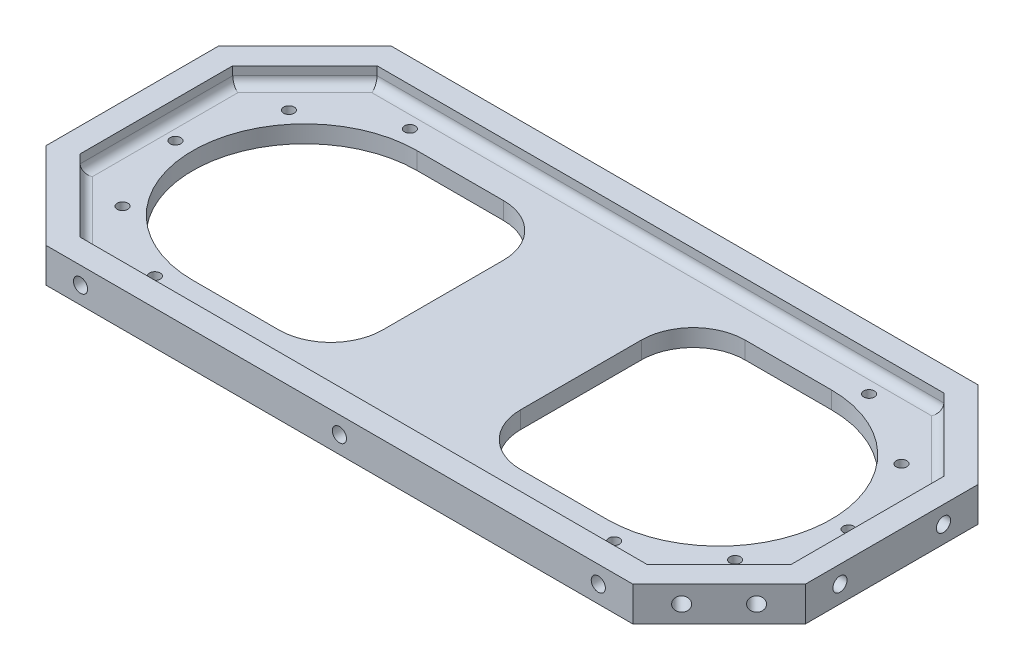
ISO-10303-21;
HEADER;
FILE_DESCRIPTION(('STEP AP214'),'2;1');
FILE_NAME('part.step','',(''),(''),'','','');
FILE_SCHEMA(('AUTOMOTIVE_DESIGN { 1 0 10303 214 1 1 1 1 }'));
ENDSEC;
DATA;
#1=APPLICATION_CONTEXT('core data for automotive mechanical design processes');
#2=APPLICATION_PROTOCOL_DEFINITION('international standard','automotive_design',2000,#1);
#3=PRODUCT_CONTEXT('',#1,'mechanical');
#4=PRODUCT('Part','Part','',(#3));
#5=PRODUCT_RELATED_PRODUCT_CATEGORY('part','',(#4));
#6=PRODUCT_DEFINITION_FORMATION('','',#4);
#7=PRODUCT_DEFINITION_CONTEXT('part definition',#1,'design');
#8=PRODUCT_DEFINITION('design','',#6,#7);
#9=PRODUCT_DEFINITION_SHAPE('','',#8);
#10=(LENGTH_UNIT() NAMED_UNIT(*) SI_UNIT(.MILLI.,.METRE.));
#11=(NAMED_UNIT(*) PLANE_ANGLE_UNIT() SI_UNIT($,.RADIAN.));
#12=(NAMED_UNIT(*) SI_UNIT($,.STERADIAN.) SOLID_ANGLE_UNIT());
#13=UNCERTAINTY_MEASURE_WITH_UNIT(LENGTH_MEASURE(1.E-05),#10,'distance_accuracy_value','');
#14=(GEOMETRIC_REPRESENTATION_CONTEXT(3) GLOBAL_UNCERTAINTY_ASSIGNED_CONTEXT((#13)) GLOBAL_UNIT_ASSIGNED_CONTEXT((#10,
#11,#12)) REPRESENTATION_CONTEXT('',''));
#15=CARTESIAN_POINT('',(0.,0.,0.));
#16=DIRECTION('',(0.,0.,1.));
#17=DIRECTION('',(1.,0.,0.));
#18=AXIS2_PLACEMENT_3D('',#15,#16,#17);
#19=CARTESIAN_POINT('',(60.,10.,37.5));
#20=DIRECTION('',(0.,-1.,0.));
#21=DIRECTION('',(0.,0.,-1.));
#22=AXIS2_PLACEMENT_3D('',#19,#20,#21);
#23=CYLINDRICAL_SURFACE('',#22,32.5);
#24=DIRECTION('',(0.,-1.,0.));
#25=VECTOR('',#24,1.);
#26=CARTESIAN_POINT('',(60.,10.,70.));
#27=LINE('',#26,#25);
#28=CARTESIAN_POINT('',(60.,5.,70.));
#29=VERTEX_POINT('',#28);
#30=CARTESIAN_POINT('',(60.,0.,70.));
#31=VERTEX_POINT('',#30);
#32=EDGE_CURVE('E492',#29,#31,#27,.T.);
#33=ORIENTED_EDGE('',*,*,#32,.F.);
#34=CARTESIAN_POINT('',(60.,5.,37.5));
#35=DIRECTION('',(0.,1.,0.));
#36=DIRECTION('',(0.,0.,1.));
#37=AXIS2_PLACEMENT_3D('',#34,#35,#36);
#38=CIRCLE('',#37,32.5);
#39=CARTESIAN_POINT('',(60.,5.,4.99999999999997));
#40=VERTEX_POINT('',#39);
#41=EDGE_CURVE('E338',#29,#40,#38,.T.);
#42=ORIENTED_EDGE('',*,*,#41,.T.);
#43=DIRECTION('',(0.,-1.,0.));
#44=VECTOR('',#43,1.);
#45=CARTESIAN_POINT('',(60.,10.,4.99999999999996));
#46=LINE('',#45,#44);
#47=CARTESIAN_POINT('',(60.,0.,4.99999999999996));
#48=VERTEX_POINT('',#47);
#49=EDGE_CURVE('E463',#40,#48,#46,.T.);
#50=ORIENTED_EDGE('',*,*,#49,.T.);
#51=CARTESIAN_POINT('',(60.,0.,37.5));
#52=DIRECTION('',(0.,1.,0.));
#53=DIRECTION('',(0.,0.,1.));
#54=AXIS2_PLACEMENT_3D('',#51,#52,#53);
#55=CIRCLE('',#54,32.5);
#56=EDGE_CURVE('E447',#31,#48,#55,.T.);
#57=ORIENTED_EDGE('',*,*,#56,.F.);
#58=EDGE_LOOP('',(#33,#42,#50,#57));
#59=FACE_BOUND('',#58,.T.);
#60=ADVANCED_FACE('F42',(#59),#23,.F.);
#61=CARTESIAN_POINT('',(0.,10.,70.));
#62=DIRECTION('',(0.,0.,1.));
#63=DIRECTION('',(1.,0.,0.));
#64=AXIS2_PLACEMENT_3D('',#61,#62,#63);
#65=PLANE('',#64);
#66=DIRECTION('',(-1.,0.,0.));
#67=VECTOR('',#66,1.);
#68=CARTESIAN_POINT('',(0.,5.,70.));
#69=LINE('',#68,#67);
#70=CARTESIAN_POINT('',(35.,5.,70.));
#71=VERTEX_POINT('',#70);
#72=EDGE_CURVE('E336',#29,#71,#69,.T.);
#73=ORIENTED_EDGE('',*,*,#72,.F.);
#74=ORIENTED_EDGE('',*,*,#32,.T.);
#75=DIRECTION('',(-1.,0.,0.));
#76=VECTOR('',#75,1.);
#77=CARTESIAN_POINT('',(0.,0.,70.));
#78=LINE('',#77,#76);
#79=CARTESIAN_POINT('',(35.,0.,70.));
#80=VERTEX_POINT('',#79);
#81=EDGE_CURVE('E466',#31,#80,#78,.T.);
#82=ORIENTED_EDGE('',*,*,#81,.T.);
#83=DIRECTION('',(0.,-1.,0.));
#84=VECTOR('',#83,1.);
#85=CARTESIAN_POINT('',(35.,10.,70.));
#86=LINE('',#85,#84);
#87=EDGE_CURVE('E507',#80,#71,#86,.F.);
#88=ORIENTED_EDGE('',*,*,#87,.T.);
#89=EDGE_LOOP('',(#73,#74,#82,#88));
#90=FACE_BOUND('',#89,.T.);
#91=ADVANCED_FACE('F744',(#90),#65,.F.);
#92=CARTESIAN_POINT('',(20.,10.,0.));
#93=DIRECTION('',(1.,0.,0.));
#94=DIRECTION('',(0.,0.,-1.));
#95=AXIS2_PLACEMENT_3D('',#92,#93,#94);
#96=PLANE('',#95);
#97=DIRECTION('',(0.,-1.,0.));
#98=VECTOR('',#97,1.);
#99=CARTESIAN_POINT('',(20.,10.,20.));
#100=LINE('',#99,#98);
#101=CARTESIAN_POINT('',(20.,0.,20.));
#102=VERTEX_POINT('',#101);
#103=CARTESIAN_POINT('',(20.,5.,20.));
#104=VERTEX_POINT('',#103);
#105=EDGE_CURVE('E504',#102,#104,#100,.F.);
#106=ORIENTED_EDGE('',*,*,#105,.T.);
#107=DIRECTION('',(0.,0.,1.));
#108=VECTOR('',#107,1.);
#109=CARTESIAN_POINT('',(20.,5.,0.));
#110=LINE('',#109,#108);
#111=CARTESIAN_POINT('',(20.,5.,55.));
#112=VERTEX_POINT('',#111);
#113=EDGE_CURVE('E333',#104,#112,#110,.T.);
#114=ORIENTED_EDGE('',*,*,#113,.T.);
#115=DIRECTION('',(0.,-1.,0.));
#116=VECTOR('',#115,1.);
#117=CARTESIAN_POINT('',(20.,10.,55.));
#118=LINE('',#117,#116);
#119=CARTESIAN_POINT('',(20.,0.,55.));
#120=VERTEX_POINT('',#119);
#121=EDGE_CURVE('E502',#112,#120,#118,.T.);
#122=ORIENTED_EDGE('',*,*,#121,.T.);
#123=DIRECTION('',(0.,0.,1.));
#124=VECTOR('',#123,1.);
#125=CARTESIAN_POINT('',(20.,0.,0.));
#126=LINE('',#125,#124);
#127=EDGE_CURVE('E469',#102,#120,#126,.T.);
#128=ORIENTED_EDGE('',*,*,#127,.F.);
#129=EDGE_LOOP('',(#106,#114,#122,#128));
#130=FACE_BOUND('',#129,.T.);
#131=ADVANCED_FACE('F751',(#130),#96,.T.);
#132=CARTESIAN_POINT('',(0.,10.,4.99999999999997));
#133=DIRECTION('',(0.,0.,1.));
#134=DIRECTION('',(1.,0.,0.));
#135=AXIS2_PLACEMENT_3D('',#132,#133,#134);
#136=PLANE('',#135);
#137=ORIENTED_EDGE('',*,*,#49,.F.);
#138=DIRECTION('',(-1.,0.,0.));
#139=VECTOR('',#138,1.);
#140=CARTESIAN_POINT('',(0.,5.,4.99999999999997));
#141=LINE('',#140,#139);
#142=CARTESIAN_POINT('',(35.,5.,4.99999999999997));
#143=VERTEX_POINT('',#142);
#144=EDGE_CURVE('E343',#40,#143,#141,.T.);
#145=ORIENTED_EDGE('',*,*,#144,.T.);
#146=DIRECTION('',(0.,-1.,0.));
#147=VECTOR('',#146,1.);
#148=CARTESIAN_POINT('',(35.,0.,4.99999999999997));
#149=LINE('',#148,#147);
#150=CARTESIAN_POINT('',(35.,0.,4.99999999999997));
#151=VERTEX_POINT('',#150);
#152=EDGE_CURVE('E498',#143,#151,#149,.T.);
#153=ORIENTED_EDGE('',*,*,#152,.T.);
#154=DIRECTION('',(-1.,0.,0.));
#155=VECTOR('',#154,1.);
#156=CARTESIAN_POINT('',(0.,0.,4.99999999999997));
#157=LINE('',#156,#155);
#158=EDGE_CURVE('E472',#48,#151,#157,.T.);
#159=ORIENTED_EDGE('',*,*,#158,.F.);
#160=EDGE_LOOP('',(#137,#145,#153,#159));
#161=FACE_BOUND('',#160,.T.);
#162=ADVANCED_FACE('F910',(#161),#136,.T.);
#163=CARTESIAN_POINT('',(97.5,0.,37.5));
#164=DIRECTION('',(0.,1.,0.));
#165=DIRECTION('',(0.,0.,1.));
#166=AXIS2_PLACEMENT_3D('',#163,#164,#165);
#167=CYLINDRICAL_SURFACE('',#166,1.54999999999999);
#168=CARTESIAN_POINT('',(97.5,0.,37.5));
#169=DIRECTION('',(0.,1.,0.));
#170=DIRECTION('',(0.,0.,1.));
#171=AXIS2_PLACEMENT_3D('',#168,#169,#170);
#172=CIRCLE('',#171,1.54999999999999);
#173=CARTESIAN_POINT('',(97.5,0.,39.05));
#174=VERTEX_POINT('',#173);
#175=EDGE_CURVE('E444',#174,#174,#172,.T.);
#176=ORIENTED_EDGE('',*,*,#175,.F.);
#177=EDGE_LOOP('',(#176));
#178=FACE_BOUND('',#177,.T.);
#179=CARTESIAN_POINT('',(97.5,5.,37.5));
#180=DIRECTION('',(0.,1.,0.));
#181=DIRECTION('',(0.,0.,1.));
#182=AXIS2_PLACEMENT_3D('',#179,#180,#181);
#183=CIRCLE('',#182,1.54999999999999);
#184=CARTESIAN_POINT('',(97.5,5.,39.05));
#185=VERTEX_POINT('',#184);
#186=EDGE_CURVE('E358',#185,#185,#183,.F.);
#187=ORIENTED_EDGE('',*,*,#186,.F.);
#188=EDGE_LOOP('',(#187));
#189=FACE_BOUND('',#188,.T.);
#190=ADVANCED_FACE('F906',(#178,#189),#167,.F.);
#191=CARTESIAN_POINT('',(88.7266666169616,0.,13.3954646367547));
#192=DIRECTION('',(0.,1.,0.));
#193=DIRECTION('',(0.,0.,1.));
#194=AXIS2_PLACEMENT_3D('',#191,#192,#193);
#195=CYLINDRICAL_SURFACE('',#194,1.54999999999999);
#196=CARTESIAN_POINT('',(88.7266666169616,0.,13.3954646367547));
#197=DIRECTION('',(0.,1.,0.));
#198=DIRECTION('',(0.642787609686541,0.,0.766044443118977));
#199=AXIS2_PLACEMENT_3D('',#196,#197,#198);
#200=CIRCLE('',#199,1.54999999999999);
#201=CARTESIAN_POINT('',(89.7229874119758,0.,14.5828335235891));
#202=VERTEX_POINT('',#201);
#203=EDGE_CURVE('E436',#202,#202,#200,.T.);
#204=ORIENTED_EDGE('',*,*,#203,.F.);
#205=EDGE_LOOP('',(#204));
#206=FACE_BOUND('',#205,.T.);
#207=CARTESIAN_POINT('',(88.7266666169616,5.,13.3954646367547));
#208=DIRECTION('',(0.,1.,0.));
#209=DIRECTION('',(0.,0.,1.));
#210=AXIS2_PLACEMENT_3D('',#207,#208,#209);
#211=CIRCLE('',#210,1.54999999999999);
#212=CARTESIAN_POINT('',(88.7266666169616,5.,14.9454646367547));
#213=VERTEX_POINT('',#212);
#214=EDGE_CURVE('E355',#213,#213,#211,.F.);
#215=ORIENTED_EDGE('',*,*,#214,.F.);
#216=EDGE_LOOP('',(#215));
#217=FACE_BOUND('',#216,.T.);
#218=ADVANCED_FACE('F896',(#206,#217),#195,.F.);
#219=CARTESIAN_POINT('',(66.5118066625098,0.,0.569709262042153));
#220=DIRECTION('',(0.,1.,0.));
#221=DIRECTION('',(0.,0.,1.));
#222=AXIS2_PLACEMENT_3D('',#219,#220,#221);
#223=CYLINDRICAL_SURFACE('',#222,1.54999999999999);
#224=CARTESIAN_POINT('',(66.5118066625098,0.,0.569709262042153));
#225=DIRECTION('',(0.,1.,0.));
#226=DIRECTION('',(0.984807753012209,0.,0.173648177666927));
#227=AXIS2_PLACEMENT_3D('',#224,#225,#226);
#228=CIRCLE('',#227,1.54999999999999);
#229=CARTESIAN_POINT('',(68.0382586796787,0.,0.83886393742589));
#230=VERTEX_POINT('',#229);
#231=EDGE_CURVE('E433',#230,#230,#228,.T.);
#232=ORIENTED_EDGE('',*,*,#231,.F.);
#233=EDGE_LOOP('',(#232));
#234=FACE_BOUND('',#233,.T.);
#235=CARTESIAN_POINT('',(66.5118066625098,5.,0.569709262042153));
#236=DIRECTION('',(0.,1.,0.));
#237=DIRECTION('',(0.,0.,1.));
#238=AXIS2_PLACEMENT_3D('',#235,#236,#237);
#239=CIRCLE('',#238,1.54999999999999);
#240=CARTESIAN_POINT('',(66.5118066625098,5.,2.11970926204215));
#241=VERTEX_POINT('',#240);
#242=EDGE_CURVE('E352',#241,#241,#239,.F.);
#243=ORIENTED_EDGE('',*,*,#242,.F.);
#244=EDGE_LOOP('',(#243));
#245=FACE_BOUND('',#244,.T.);
#246=ADVANCED_FACE('F892',(#234,#245),#223,.F.);
#247=CARTESIAN_POINT('',(88.7266666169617,0.,61.6045353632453));
#248=DIRECTION('',(0.,1.,0.));
#249=DIRECTION('',(0.,0.,1.));
#250=AXIS2_PLACEMENT_3D('',#247,#248,#249);
#251=CYLINDRICAL_SURFACE('',#250,1.54999999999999);
#252=CARTESIAN_POINT('',(88.7266666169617,0.,61.6045353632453));
#253=DIRECTION('',(0.,1.,0.));
#254=DIRECTION('',(-0.642787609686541,0.,0.766044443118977));
#255=AXIS2_PLACEMENT_3D('',#252,#253,#254);
#256=CIRCLE('',#255,1.54999999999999);
#257=CARTESIAN_POINT('',(87.7303458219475,0.,62.7919042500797));
#258=VERTEX_POINT('',#257);
#259=EDGE_CURVE('E437',#258,#258,#256,.T.);
#260=ORIENTED_EDGE('',*,*,#259,.F.);
#261=EDGE_LOOP('',(#260));
#262=FACE_BOUND('',#261,.T.);
#263=CARTESIAN_POINT('',(88.7266666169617,5.,61.6045353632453));
#264=DIRECTION('',(0.,1.,0.));
#265=DIRECTION('',(0.,0.,1.));
#266=AXIS2_PLACEMENT_3D('',#263,#264,#265);
#267=CIRCLE('',#266,1.54999999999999);
#268=CARTESIAN_POINT('',(88.7266666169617,5.,63.1545353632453));
#269=VERTEX_POINT('',#268);
#270=EDGE_CURVE('E349',#269,#269,#267,.F.);
#271=ORIENTED_EDGE('',*,*,#270,.F.);
#272=EDGE_LOOP('',(#271));
#273=FACE_BOUND('',#272,.T.);
#274=ADVANCED_FACE('F895',(#262,#273),#251,.F.);
#275=CARTESIAN_POINT('',(66.5118066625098,0.,74.4302907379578));
#276=DIRECTION('',(0.,1.,0.));
#277=DIRECTION('',(0.,0.,1.));
#278=AXIS2_PLACEMENT_3D('',#275,#276,#277);
#279=CYLINDRICAL_SURFACE('',#278,1.54999999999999);
#280=CARTESIAN_POINT('',(66.5118066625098,0.,74.4302907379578));
#281=DIRECTION('',(0.,1.,0.));
#282=DIRECTION('',(-0.984807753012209,0.,0.173648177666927));
#283=AXIS2_PLACEMENT_3D('',#280,#281,#282);
#284=CIRCLE('',#283,1.54999999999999);
#285=CARTESIAN_POINT('',(64.9853546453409,0.,74.6994454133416));
#286=VERTEX_POINT('',#285);
#287=EDGE_CURVE('E432',#286,#286,#284,.T.);
#288=ORIENTED_EDGE('',*,*,#287,.F.);
#289=EDGE_LOOP('',(#288));
#290=FACE_BOUND('',#289,.T.);
#291=CARTESIAN_POINT('',(66.5118066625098,5.,74.4302907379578));
#292=DIRECTION('',(0.,1.,0.));
#293=DIRECTION('',(0.,0.,1.));
#294=AXIS2_PLACEMENT_3D('',#291,#292,#293);
#295=CIRCLE('',#294,1.54999999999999);
#296=CARTESIAN_POINT('',(66.5118066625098,5.,75.9802907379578));
#297=VERTEX_POINT('',#296);
#298=EDGE_CURVE('E346',#297,#297,#295,.F.);
#299=ORIENTED_EDGE('',*,*,#298,.F.);
#300=EDGE_LOOP('',(#299));
#301=FACE_BOUND('',#300,.T.);
#302=ADVANCED_FACE('F761',(#290,#301),#279,.F.);
#303=CARTESIAN_POINT('',(35.,10.,20.));
#304=DIRECTION('',(0.,1.,0.));
#305=DIRECTION('',(0.,0.,1.));
#306=AXIS2_PLACEMENT_3D('',#303,#304,#305);
#307=CYLINDRICAL_SURFACE('',#306,15.);
#308=CARTESIAN_POINT('',(35.,5.,20.));
#309=DIRECTION('',(0.,1.,0.));
#310=DIRECTION('',(0.,0.,1.));
#311=AXIS2_PLACEMENT_3D('',#308,#309,#310);
#312=CIRCLE('',#311,15.);
#313=EDGE_CURVE('E341',#104,#143,#312,.F.);
#314=ORIENTED_EDGE('',*,*,#313,.F.);
#315=ORIENTED_EDGE('',*,*,#105,.F.);
#316=CARTESIAN_POINT('',(35.,0.,20.));
#317=DIRECTION('',(0.,1.,0.));
#318=DIRECTION('',(0.,0.,1.));
#319=AXIS2_PLACEMENT_3D('',#316,#317,#318);
#320=CIRCLE('',#319,15.);
#321=EDGE_CURVE('E510',#151,#102,#320,.T.);
#322=ORIENTED_EDGE('',*,*,#321,.F.);
#323=ORIENTED_EDGE('',*,*,#152,.F.);
#324=EDGE_LOOP('',(#314,#315,#322,#323));
#325=FACE_BOUND('',#324,.T.);
#326=ADVANCED_FACE('F757',(#325),#307,.F.);
#327=CARTESIAN_POINT('',(35.,10.,55.));
#328=DIRECTION('',(0.,-1.,0.));
#329=DIRECTION('',(0.,0.,-1.));
#330=AXIS2_PLACEMENT_3D('',#327,#328,#329);
#331=CYLINDRICAL_SURFACE('',#330,15.);
#332=CARTESIAN_POINT('',(35.,5.,55.));
#333=DIRECTION('',(0.,1.,0.));
#334=DIRECTION('',(0.,0.,1.));
#335=AXIS2_PLACEMENT_3D('',#332,#333,#334);
#336=CIRCLE('',#335,15.);
#337=EDGE_CURVE('E331',#71,#112,#336,.F.);
#338=ORIENTED_EDGE('',*,*,#337,.F.);
#339=ORIENTED_EDGE('',*,*,#87,.F.);
#340=CARTESIAN_POINT('',(35.,0.,55.));
#341=DIRECTION('',(0.,1.,0.));
#342=DIRECTION('',(0.,0.,1.));
#343=AXIS2_PLACEMENT_3D('',#340,#341,#342);
#344=CIRCLE('',#343,15.);
#345=EDGE_CURVE('E512',#120,#80,#344,.T.);
#346=ORIENTED_EDGE('',*,*,#345,.F.);
#347=ORIENTED_EDGE('',*,*,#121,.F.);
#348=EDGE_LOOP('',(#338,#339,#346,#347));
#349=FACE_BOUND('',#348,.T.);
#350=ADVANCED_FACE('F760',(#349),#331,.F.);
#351=CARTESIAN_POINT('',(-60.,10.,37.5));
#352=DIRECTION('',(0.,-1.,0.));
#353=DIRECTION('',(0.,0.,-1.));
#354=AXIS2_PLACEMENT_3D('',#351,#352,#353);
#355=CYLINDRICAL_SURFACE('',#354,32.5);
#356=DIRECTION('',(0.,-1.,0.));
#357=VECTOR('',#356,1.);
#358=CARTESIAN_POINT('',(-60.,10.,4.99999999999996));
#359=LINE('',#358,#357);
#360=CARTESIAN_POINT('',(-60.,5.,4.99999999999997));
#361=VERTEX_POINT('',#360);
#362=CARTESIAN_POINT('',(-60.,0.,4.99999999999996));
#363=VERTEX_POINT('',#362);
#364=EDGE_CURVE('E385',#361,#363,#359,.T.);
#365=ORIENTED_EDGE('',*,*,#364,.F.);
#366=CARTESIAN_POINT('',(-60.,5.,37.5));
#367=DIRECTION('',(0.,1.,0.));
#368=DIRECTION('',(0.,0.,1.));
#369=AXIS2_PLACEMENT_3D('',#366,#367,#368);
#370=CIRCLE('',#369,32.5);
#371=CARTESIAN_POINT('',(-60.,5.,70.));
#372=VERTEX_POINT('',#371);
#373=EDGE_CURVE('E308',#361,#372,#370,.T.);
#374=ORIENTED_EDGE('',*,*,#373,.T.);
#375=DIRECTION('',(0.,-1.,0.));
#376=VECTOR('',#375,1.);
#377=CARTESIAN_POINT('',(-60.,10.,70.));
#378=LINE('',#377,#376);
#379=CARTESIAN_POINT('',(-60.,0.,70.));
#380=VERTEX_POINT('',#379);
#381=EDGE_CURVE('E407',#372,#380,#378,.T.);
#382=ORIENTED_EDGE('',*,*,#381,.T.);
#383=CARTESIAN_POINT('',(-60.,0.,37.5));
#384=DIRECTION('',(0.,-1.,0.));
#385=DIRECTION('',(0.,0.,1.));
#386=AXIS2_PLACEMENT_3D('',#383,#384,#385);
#387=CIRCLE('',#386,32.5);
#388=EDGE_CURVE('E376',#380,#363,#387,.T.);
#389=ORIENTED_EDGE('',*,*,#388,.T.);
#390=EDGE_LOOP('',(#365,#374,#382,#389));
#391=FACE_BOUND('',#390,.T.);
#392=ADVANCED_FACE('F765',(#391),#355,.F.);
#393=CARTESIAN_POINT('',(0.,10.,70.));
#394=DIRECTION('',(0.,0.,1.));
#395=DIRECTION('',(-1.,0.,0.));
#396=AXIS2_PLACEMENT_3D('',#393,#394,#395);
#397=PLANE('',#396);
#398=DIRECTION('',(-1.,0.,0.));
#399=VECTOR('',#398,1.);
#400=CARTESIAN_POINT('',(0.,5.,70.));
#401=LINE('',#400,#399);
#402=CARTESIAN_POINT('',(-35.,5.,70.));
#403=VERTEX_POINT('',#402);
#404=EDGE_CURVE('E306',#403,#372,#401,.T.);
#405=ORIENTED_EDGE('',*,*,#404,.F.);
#406=DIRECTION('',(0.,-1.,0.));
#407=VECTOR('',#406,1.);
#408=CARTESIAN_POINT('',(-35.,10.,70.));
#409=LINE('',#408,#407);
#410=CARTESIAN_POINT('',(-35.,0.,70.));
#411=VERTEX_POINT('',#410);
#412=EDGE_CURVE('E425',#411,#403,#409,.F.);
#413=ORIENTED_EDGE('',*,*,#412,.F.);
#414=DIRECTION('',(1.,0.,0.));
#415=VECTOR('',#414,1.);
#416=CARTESIAN_POINT('',(0.,0.,70.));
#417=LINE('',#416,#415);
#418=EDGE_CURVE('E388',#380,#411,#417,.T.);
#419=ORIENTED_EDGE('',*,*,#418,.F.);
#420=ORIENTED_EDGE('',*,*,#381,.F.);
#421=EDGE_LOOP('',(#405,#413,#419,#420));
#422=FACE_BOUND('',#421,.T.);
#423=ADVANCED_FACE('F881',(#422),#397,.F.);
#424=CARTESIAN_POINT('',(-20.,10.,0.));
#425=DIRECTION('',(-1.,0.,0.));
#426=DIRECTION('',(0.,0.,-1.));
#427=AXIS2_PLACEMENT_3D('',#424,#425,#426);
#428=PLANE('',#427);
#429=DIRECTION('',(0.,-1.,0.));
#430=VECTOR('',#429,1.);
#431=CARTESIAN_POINT('',(-20.,10.,55.));
#432=LINE('',#431,#430);
#433=CARTESIAN_POINT('',(-20.,5.,55.));
#434=VERTEX_POINT('',#433);
#435=CARTESIAN_POINT('',(-20.,0.,55.));
#436=VERTEX_POINT('',#435);
#437=EDGE_CURVE('E420',#434,#436,#432,.T.);
#438=ORIENTED_EDGE('',*,*,#437,.F.);
#439=DIRECTION('',(0.,0.,-1.));
#440=VECTOR('',#439,1.);
#441=CARTESIAN_POINT('',(-20.,5.,0.));
#442=LINE('',#441,#440);
#443=CARTESIAN_POINT('',(-20.,5.,20.));
#444=VERTEX_POINT('',#443);
#445=EDGE_CURVE('E293',#434,#444,#442,.T.);
#446=ORIENTED_EDGE('',*,*,#445,.T.);
#447=DIRECTION('',(0.,-1.,0.));
#448=VECTOR('',#447,1.);
#449=CARTESIAN_POINT('',(-20.,10.,20.));
#450=LINE('',#449,#448);
#451=CARTESIAN_POINT('',(-20.,0.,20.));
#452=VERTEX_POINT('',#451);
#453=EDGE_CURVE('E422',#452,#444,#450,.F.);
#454=ORIENTED_EDGE('',*,*,#453,.F.);
#455=DIRECTION('',(0.,0.,1.));
#456=VECTOR('',#455,1.);
#457=CARTESIAN_POINT('',(-20.,0.,0.));
#458=LINE('',#457,#456);
#459=EDGE_CURVE('E391',#452,#436,#458,.T.);
#460=ORIENTED_EDGE('',*,*,#459,.T.);
#461=EDGE_LOOP('',(#438,#446,#454,#460));
#462=FACE_BOUND('',#461,.T.);
#463=ADVANCED_FACE('F877',(#462),#428,.T.);
#464=CARTESIAN_POINT('',(0.,10.,4.99999999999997));
#465=DIRECTION('',(0.,0.,1.));
#466=DIRECTION('',(-1.,0.,0.));
#467=AXIS2_PLACEMENT_3D('',#464,#465,#466);
#468=PLANE('',#467);
#469=DIRECTION('',(0.,-1.,0.));
#470=VECTOR('',#469,1.);
#471=CARTESIAN_POINT('',(-35.,0.,4.99999999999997));
#472=LINE('',#471,#470);
#473=CARTESIAN_POINT('',(-35.,5.,4.99999999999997));
#474=VERTEX_POINT('',#473);
#475=CARTESIAN_POINT('',(-35.,0.,4.99999999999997));
#476=VERTEX_POINT('',#475);
#477=EDGE_CURVE('E416',#474,#476,#472,.T.);
#478=ORIENTED_EDGE('',*,*,#477,.F.);
#479=DIRECTION('',(-1.,0.,0.));
#480=VECTOR('',#479,1.);
#481=CARTESIAN_POINT('',(0.,5.,4.99999999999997));
#482=LINE('',#481,#480);
#483=EDGE_CURVE('E313',#474,#361,#482,.T.);
#484=ORIENTED_EDGE('',*,*,#483,.T.);
#485=ORIENTED_EDGE('',*,*,#364,.T.);
#486=DIRECTION('',(1.,0.,0.));
#487=VECTOR('',#486,1.);
#488=CARTESIAN_POINT('',(0.,0.,4.99999999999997));
#489=LINE('',#488,#487);
#490=EDGE_CURVE('E394',#363,#476,#489,.T.);
#491=ORIENTED_EDGE('',*,*,#490,.T.);
#492=EDGE_LOOP('',(#478,#484,#485,#491));
#493=FACE_BOUND('',#492,.T.);
#494=ADVANCED_FACE('F864',(#493),#468,.T.);
#495=CARTESIAN_POINT('',(-97.5,0.,37.5));
#496=DIRECTION('',(0.,1.,0.));
#497=DIRECTION('',(0.,0.,1.));
#498=AXIS2_PLACEMENT_3D('',#495,#496,#497);
#499=CYLINDRICAL_SURFACE('',#498,1.54999999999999);
#500=CARTESIAN_POINT('',(-97.5,0.,37.5));
#501=DIRECTION('',(0.,-1.,0.));
#502=DIRECTION('',(0.,0.,1.));
#503=AXIS2_PLACEMENT_3D('',#500,#501,#502);
#504=CIRCLE('',#503,1.54999999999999);
#505=CARTESIAN_POINT('',(-97.5,0.,39.05));
#506=VERTEX_POINT('',#505);
#507=EDGE_CURVE('E373',#506,#506,#504,.T.);
#508=ORIENTED_EDGE('',*,*,#507,.T.);
#509=EDGE_LOOP('',(#508));
#510=FACE_BOUND('',#509,.T.);
#511=CARTESIAN_POINT('',(-97.5,5.,37.5));
#512=DIRECTION('',(0.,1.,0.));
#513=DIRECTION('',(0.,0.,1.));
#514=AXIS2_PLACEMENT_3D('',#511,#512,#513);
#515=CIRCLE('',#514,1.54999999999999);
#516=CARTESIAN_POINT('',(-97.5,5.,39.05));
#517=VERTEX_POINT('',#516);
#518=EDGE_CURVE('E328',#517,#517,#515,.F.);
#519=ORIENTED_EDGE('',*,*,#518,.F.);
#520=EDGE_LOOP('',(#519));
#521=FACE_BOUND('',#520,.T.);
#522=ADVANCED_FACE('F860',(#510,#521),#499,.F.);
#523=CARTESIAN_POINT('',(-88.7266666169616,0.,13.3954646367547));
#524=DIRECTION('',(0.,1.,0.));
#525=DIRECTION('',(0.,0.,1.));
#526=AXIS2_PLACEMENT_3D('',#523,#524,#525);
#527=CYLINDRICAL_SURFACE('',#526,1.54999999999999);
#528=CARTESIAN_POINT('',(-88.7266666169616,0.,13.3954646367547));
#529=DIRECTION('',(0.,-1.,0.));
#530=DIRECTION('',(-0.642787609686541,0.,0.766044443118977));
#531=AXIS2_PLACEMENT_3D('',#528,#529,#530);
#532=CIRCLE('',#531,1.54999999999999);
#533=CARTESIAN_POINT('',(-89.7229874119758,0.,14.5828335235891));
#534=VERTEX_POINT('',#533);
#535=EDGE_CURVE('E365',#534,#534,#532,.T.);
#536=ORIENTED_EDGE('',*,*,#535,.T.);
#537=EDGE_LOOP('',(#536));
#538=FACE_BOUND('',#537,.T.);
#539=CARTESIAN_POINT('',(-88.7266666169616,5.,13.3954646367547));
#540=DIRECTION('',(0.,1.,0.));
#541=DIRECTION('',(0.,0.,1.));
#542=AXIS2_PLACEMENT_3D('',#539,#540,#541);
#543=CIRCLE('',#542,1.54999999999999);
#544=CARTESIAN_POINT('',(-88.7266666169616,5.,14.9454646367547));
#545=VERTEX_POINT('',#544);
#546=EDGE_CURVE('E325',#545,#545,#543,.F.);
#547=ORIENTED_EDGE('',*,*,#546,.F.);
#548=EDGE_LOOP('',(#547));
#549=FACE_BOUND('',#548,.T.);
#550=ADVANCED_FACE('F849',(#538,#549),#527,.F.);
#551=CARTESIAN_POINT('',(-66.5118066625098,0.,0.569709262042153));
#552=DIRECTION('',(0.,1.,0.));
#553=DIRECTION('',(0.,0.,1.));
#554=AXIS2_PLACEMENT_3D('',#551,#552,#553);
#555=CYLINDRICAL_SURFACE('',#554,1.54999999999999);
#556=CARTESIAN_POINT('',(-66.5118066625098,0.,0.569709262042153));
#557=DIRECTION('',(0.,-1.,0.));
#558=DIRECTION('',(-0.984807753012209,0.,0.173648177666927));
#559=AXIS2_PLACEMENT_3D('',#556,#557,#558);
#560=CIRCLE('',#559,1.54999999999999);
#561=CARTESIAN_POINT('',(-68.0382586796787,0.,0.83886393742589));
#562=VERTEX_POINT('',#561);
#563=EDGE_CURVE('E362',#562,#562,#560,.T.);
#564=ORIENTED_EDGE('',*,*,#563,.T.);
#565=EDGE_LOOP('',(#564));
#566=FACE_BOUND('',#565,.T.);
#567=CARTESIAN_POINT('',(-66.5118066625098,5.,0.569709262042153));
#568=DIRECTION('',(0.,1.,0.));
#569=DIRECTION('',(0.,0.,1.));
#570=AXIS2_PLACEMENT_3D('',#567,#568,#569);
#571=CIRCLE('',#570,1.54999999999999);
#572=CARTESIAN_POINT('',(-66.5118066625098,5.,2.11970926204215));
#573=VERTEX_POINT('',#572);
#574=EDGE_CURVE('E322',#573,#573,#571,.F.);
#575=ORIENTED_EDGE('',*,*,#574,.F.);
#576=EDGE_LOOP('',(#575));
#577=FACE_BOUND('',#576,.T.);
#578=ADVANCED_FACE('F845',(#566,#577),#555,.F.);
#579=CARTESIAN_POINT('',(-88.7266666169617,0.,61.6045353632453));
#580=DIRECTION('',(0.,1.,0.));
#581=DIRECTION('',(0.,0.,1.));
#582=AXIS2_PLACEMENT_3D('',#579,#580,#581);
#583=CYLINDRICAL_SURFACE('',#582,1.54999999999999);
#584=CARTESIAN_POINT('',(-88.7266666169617,0.,61.6045353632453));
#585=DIRECTION('',(0.,-1.,0.));
#586=DIRECTION('',(0.642787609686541,0.,0.766044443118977));
#587=AXIS2_PLACEMENT_3D('',#584,#585,#586);
#588=CIRCLE('',#587,1.54999999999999);
#589=CARTESIAN_POINT('',(-87.7303458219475,0.,62.7919042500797));
#590=VERTEX_POINT('',#589);
#591=EDGE_CURVE('E366',#590,#590,#588,.T.);
#592=ORIENTED_EDGE('',*,*,#591,.T.);
#593=EDGE_LOOP('',(#592));
#594=FACE_BOUND('',#593,.T.);
#595=CARTESIAN_POINT('',(-88.7266666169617,5.,61.6045353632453));
#596=DIRECTION('',(0.,1.,0.));
#597=DIRECTION('',(0.,0.,1.));
#598=AXIS2_PLACEMENT_3D('',#595,#596,#597);
#599=CIRCLE('',#598,1.54999999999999);
#600=CARTESIAN_POINT('',(-88.7266666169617,5.,63.1545353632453));
#601=VERTEX_POINT('',#600);
#602=EDGE_CURVE('E319',#601,#601,#599,.F.);
#603=ORIENTED_EDGE('',*,*,#602,.F.);
#604=EDGE_LOOP('',(#603));
#605=FACE_BOUND('',#604,.T.);
#606=ADVANCED_FACE('F848',(#594,#605),#583,.F.);
#607=CARTESIAN_POINT('',(-66.5118066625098,0.,74.4302907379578));
#608=DIRECTION('',(0.,1.,0.));
#609=DIRECTION('',(0.,0.,1.));
#610=AXIS2_PLACEMENT_3D('',#607,#608,#609);
#611=CYLINDRICAL_SURFACE('',#610,1.54999999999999);
#612=CARTESIAN_POINT('',(-66.5118066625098,0.,74.4302907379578));
#613=DIRECTION('',(0.,-1.,0.));
#614=DIRECTION('',(0.984807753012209,0.,0.173648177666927));
#615=AXIS2_PLACEMENT_3D('',#612,#613,#614);
#616=CIRCLE('',#615,1.54999999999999);
#617=CARTESIAN_POINT('',(-64.9853546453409,0.,74.6994454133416));
#618=VERTEX_POINT('',#617);
#619=EDGE_CURVE('E361',#618,#618,#616,.T.);
#620=ORIENTED_EDGE('',*,*,#619,.T.);
#621=EDGE_LOOP('',(#620));
#622=FACE_BOUND('',#621,.T.);
#623=CARTESIAN_POINT('',(-66.5118066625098,5.,74.4302907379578));
#624=DIRECTION('',(0.,1.,0.));
#625=DIRECTION('',(0.,0.,1.));
#626=AXIS2_PLACEMENT_3D('',#623,#624,#625);
#627=CIRCLE('',#626,1.54999999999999);
#628=CARTESIAN_POINT('',(-66.5118066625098,5.,75.9802907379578));
#629=VERTEX_POINT('',#628);
#630=EDGE_CURVE('E316',#629,#629,#627,.F.);
#631=ORIENTED_EDGE('',*,*,#630,.F.);
#632=EDGE_LOOP('',(#631));
#633=FACE_BOUND('',#632,.T.);
#634=ADVANCED_FACE('F853',(#622,#633),#611,.F.);
#635=CARTESIAN_POINT('',(-35.,10.,20.));
#636=DIRECTION('',(0.,1.,0.));
#637=DIRECTION('',(0.,0.,1.));
#638=AXIS2_PLACEMENT_3D('',#635,#636,#637);
#639=CYLINDRICAL_SURFACE('',#638,15.);
#640=CARTESIAN_POINT('',(-35.,5.,20.));
#641=DIRECTION('',(0.,1.,0.));
#642=DIRECTION('',(0.,0.,1.));
#643=AXIS2_PLACEMENT_3D('',#640,#641,#642);
#644=CIRCLE('',#643,15.);
#645=EDGE_CURVE('E311',#474,#444,#644,.F.);
#646=ORIENTED_EDGE('',*,*,#645,.F.);
#647=ORIENTED_EDGE('',*,*,#477,.T.);
#648=CARTESIAN_POINT('',(-35.,0.,20.));
#649=DIRECTION('',(0.,-1.,0.));
#650=DIRECTION('',(0.,0.,1.));
#651=AXIS2_PLACEMENT_3D('',#648,#649,#650);
#652=CIRCLE('',#651,15.);
#653=EDGE_CURVE('E428',#476,#452,#652,.T.);
#654=ORIENTED_EDGE('',*,*,#653,.T.);
#655=ORIENTED_EDGE('',*,*,#453,.T.);
#656=EDGE_LOOP('',(#646,#647,#654,#655));
#657=FACE_BOUND('',#656,.T.);
#658=ADVANCED_FACE('F737',(#657),#639,.F.);
#659=CARTESIAN_POINT('',(-35.,10.,55.));
#660=DIRECTION('',(0.,-1.,0.));
#661=DIRECTION('',(0.,0.,-1.));
#662=AXIS2_PLACEMENT_3D('',#659,#660,#661);
#663=CYLINDRICAL_SURFACE('',#662,15.);
#664=CARTESIAN_POINT('',(-35.,5.,55.));
#665=DIRECTION('',(0.,1.,0.));
#666=DIRECTION('',(0.,0.,1.));
#667=AXIS2_PLACEMENT_3D('',#664,#665,#666);
#668=CIRCLE('',#667,15.);
#669=EDGE_CURVE('E514',#434,#403,#668,.F.);
#670=ORIENTED_EDGE('',*,*,#669,.F.);
#671=ORIENTED_EDGE('',*,*,#437,.T.);
#672=CARTESIAN_POINT('',(-35.,0.,55.));
#673=DIRECTION('',(0.,-1.,0.));
#674=DIRECTION('',(0.,0.,1.));
#675=AXIS2_PLACEMENT_3D('',#672,#673,#674);
#676=CIRCLE('',#675,15.);
#677=EDGE_CURVE('E430',#436,#411,#676,.T.);
#678=ORIENTED_EDGE('',*,*,#677,.T.);
#679=ORIENTED_EDGE('',*,*,#412,.T.);
#680=EDGE_LOOP('',(#670,#671,#678,#679));
#681=FACE_BOUND('',#680,.T.);
#682=ADVANCED_FACE('F727',(#681),#663,.F.);
#683=CARTESIAN_POINT('',(0.,10.,87.5));
#684=DIRECTION('',(0.,0.,-1.));
#685=DIRECTION('',(-1.,0.,0.));
#686=AXIS2_PLACEMENT_3D('',#683,#684,#685);
#687=PLANE('',#686);
#688=CARTESIAN_POINT('',(-74.9999999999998,5.,87.5));
#689=DIRECTION('',(0.,0.,1.));
#690=DIRECTION('',(1.,0.,0.));
#691=AXIS2_PLACEMENT_3D('',#688,#689,#690);
#692=CIRCLE('',#691,2.05);
#693=CARTESIAN_POINT('',(-72.9499999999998,5.,87.5));
#694=VERTEX_POINT('',#693);
#695=EDGE_CURVE('E624',#694,#694,#692,.T.);
#696=ORIENTED_EDGE('',*,*,#695,.F.);
#697=EDGE_LOOP('',(#696));
#698=FACE_BOUND('',#697,.T.);
#699=CARTESIAN_POINT('',(-1.64985200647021E-13,5.,87.5));
#700=DIRECTION('',(0.,0.,1.));
#701=DIRECTION('',(1.,0.,0.));
#702=AXIS2_PLACEMENT_3D('',#699,#700,#701);
#703=CIRCLE('',#702,2.04999999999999);
#704=CARTESIAN_POINT('',(2.04999999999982,5.,87.5));
#705=VERTEX_POINT('',#704);
#706=EDGE_CURVE('E618',#705,#705,#703,.T.);
#707=ORIENTED_EDGE('',*,*,#706,.F.);
#708=EDGE_LOOP('',(#707));
#709=FACE_BOUND('',#708,.T.);
#710=CARTESIAN_POINT('',(74.9999999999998,5.,87.5));
#711=DIRECTION('',(0.,0.,1.));
#712=DIRECTION('',(1.,0.,0.));
#713=AXIS2_PLACEMENT_3D('',#710,#711,#712);
#714=CIRCLE('',#713,2.05);
#715=CARTESIAN_POINT('',(77.0499999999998,5.,87.5));
#716=VERTEX_POINT('',#715);
#717=EDGE_CURVE('E612',#716,#716,#714,.T.);
#718=ORIENTED_EDGE('',*,*,#717,.F.);
#719=EDGE_LOOP('',(#718));
#720=FACE_BOUND('',#719,.T.);
#721=DIRECTION('',(1.,0.,0.));
#722=VECTOR('',#721,1.);
#723=CARTESIAN_POINT('',(0.,0.,87.5));
#724=LINE('',#723,#722);
#725=CARTESIAN_POINT('',(-84.9999999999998,0.,87.5));
#726=VERTEX_POINT('',#725);
#727=CARTESIAN_POINT('',(84.9999999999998,0.,87.5));
#728=VERTEX_POINT('',#727);
#729=EDGE_CURVE('E475',#726,#728,#724,.T.);
#730=ORIENTED_EDGE('',*,*,#729,.T.);
#731=DIRECTION('',(0.,-1.,0.));
#732=VECTOR('',#731,1.);
#733=CARTESIAN_POINT('',(84.9999999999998,10.,87.5));
#734=LINE('',#733,#732);
#735=CARTESIAN_POINT('',(84.9999999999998,10.,87.5));
#736=VERTEX_POINT('',#735);
#737=EDGE_CURVE('E496',#736,#728,#734,.T.);
#738=ORIENTED_EDGE('',*,*,#737,.F.);
#739=DIRECTION('',(1.,0.,0.));
#740=VECTOR('',#739,1.);
#741=CARTESIAN_POINT('',(0.,10.,87.5));
#742=LINE('',#741,#740);
#743=CARTESIAN_POINT('',(-84.9999999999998,10.,87.5));
#744=VERTEX_POINT('',#743);
#745=EDGE_CURVE('E448',#744,#736,#742,.T.);
#746=ORIENTED_EDGE('',*,*,#745,.F.);
#747=DIRECTION('',(0.,-1.,0.));
#748=VECTOR('',#747,1.);
#749=CARTESIAN_POINT('',(-84.9999999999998,10.,87.5));
#750=LINE('',#749,#748);
#751=EDGE_CURVE('E413',#744,#726,#750,.T.);
#752=ORIENTED_EDGE('',*,*,#751,.T.);
#753=EDGE_LOOP('',(#730,#738,#746,#752));
#754=FACE_BOUND('',#753,.T.);
#755=ADVANCED_FACE('F725',(#698,#709,#720,#754),#687,.F.);
#756=CARTESIAN_POINT('',(86.2499999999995,10.,86.2500000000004));
#757=DIRECTION('',(0.707106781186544,0.,0.707106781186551));
#758=DIRECTION('',(0.707106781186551,0.,-0.707106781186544));
#759=AXIS2_PLACEMENT_3D('',#756,#757,#758);
#760=PLANE('',#759);
#761=CARTESIAN_POINT('',(92.0710678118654,5.,80.4289321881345));
#762=DIRECTION('',(0.707106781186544,0.,0.707106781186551));
#763=DIRECTION('',(0.707106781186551,0.,-0.707106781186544));
#764=AXIS2_PLACEMENT_3D('',#761,#762,#763);
#765=CIRCLE('',#764,2.04999999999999);
#766=CARTESIAN_POINT('',(93.5206367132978,5.,78.9793632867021));
#767=VERTEX_POINT('',#766);
#768=EDGE_CURVE('E606',#767,#767,#765,.T.);
#769=ORIENTED_EDGE('',*,*,#768,.F.);
#770=EDGE_LOOP('',(#769));
#771=FACE_BOUND('',#770,.T.);
#772=CARTESIAN_POINT('',(102.928932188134,5.,69.5710678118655));
#773=DIRECTION('',(0.707106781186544,0.,0.707106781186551));
#774=DIRECTION('',(0.707106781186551,0.,-0.707106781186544));
#775=AXIS2_PLACEMENT_3D('',#772,#773,#774);
#776=CIRCLE('',#775,2.04999999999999);
#777=CARTESIAN_POINT('',(104.378501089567,5.,68.1214989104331));
#778=VERTEX_POINT('',#777);
#779=EDGE_CURVE('E600',#778,#778,#776,.T.);
#780=ORIENTED_EDGE('',*,*,#779,.F.);
#781=EDGE_LOOP('',(#780));
#782=FACE_BOUND('',#781,.T.);
#783=DIRECTION('',(-0.707106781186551,0.,0.707106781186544));
#784=VECTOR('',#783,1.);
#785=CARTESIAN_POINT('',(86.2499999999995,0.,86.2500000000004));
#786=LINE('',#785,#784);
#787=CARTESIAN_POINT('',(110.,0.,62.5000000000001));
#788=VERTEX_POINT('',#787);
#789=EDGE_CURVE('E478',#788,#728,#786,.T.);
#790=ORIENTED_EDGE('',*,*,#789,.F.);
#791=DIRECTION('',(0.,-1.,0.));
#792=VECTOR('',#791,1.);
#793=CARTESIAN_POINT('',(110.,10.,62.5000000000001));
#794=LINE('',#793,#792);
#795=CARTESIAN_POINT('',(110.,10.,62.5000000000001));
#796=VERTEX_POINT('',#795);
#797=EDGE_CURVE('E494',#796,#788,#794,.T.);
#798=ORIENTED_EDGE('',*,*,#797,.F.);
#799=DIRECTION('',(-0.707106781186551,0.,0.707106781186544));
#800=VECTOR('',#799,1.);
#801=CARTESIAN_POINT('',(86.2499999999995,10.,86.2500000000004));
#802=LINE('',#801,#800);
#803=EDGE_CURVE('E450',#796,#736,#802,.T.);
#804=ORIENTED_EDGE('',*,*,#803,.T.);
#805=ORIENTED_EDGE('',*,*,#737,.T.);
#806=EDGE_LOOP('',(#790,#798,#804,#805));
#807=FACE_BOUND('',#806,.T.);
#808=ADVANCED_FACE('F723',(#771,#782,#807),#760,.T.);
#809=CARTESIAN_POINT('',(110.,10.,0.));
#810=DIRECTION('',(1.,0.,0.));
#811=DIRECTION('',(0.,0.,-1.));
#812=AXIS2_PLACEMENT_3D('',#809,#810,#811);
#813=PLANE('',#812);
#814=CARTESIAN_POINT('',(110.,5.,52.5000000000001));
#815=DIRECTION('',(1.,0.,0.));
#816=DIRECTION('',(0.,0.,-1.));
#817=AXIS2_PLACEMENT_3D('',#814,#815,#816);
#818=CIRCLE('',#817,2.04999999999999);
#819=CARTESIAN_POINT('',(110.,5.,50.4500000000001));
#820=VERTEX_POINT('',#819);
#821=EDGE_CURVE('E594',#820,#820,#818,.T.);
#822=ORIENTED_EDGE('',*,*,#821,.F.);
#823=EDGE_LOOP('',(#822));
#824=FACE_BOUND('',#823,.T.);
#825=CARTESIAN_POINT('',(110.,5.,22.5000000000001));
#826=DIRECTION('',(1.,0.,0.));
#827=DIRECTION('',(0.,0.,-1.));
#828=AXIS2_PLACEMENT_3D('',#825,#826,#827);
#829=CIRCLE('',#828,2.04999999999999);
#830=CARTESIAN_POINT('',(110.,5.,20.4500000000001));
#831=VERTEX_POINT('',#830);
#832=EDGE_CURVE('E588',#831,#831,#829,.T.);
#833=ORIENTED_EDGE('',*,*,#832,.F.);
#834=EDGE_LOOP('',(#833));
#835=FACE_BOUND('',#834,.T.);
#836=DIRECTION('',(0.,0.,1.));
#837=VECTOR('',#836,1.);
#838=CARTESIAN_POINT('',(110.,0.,0.));
#839=LINE('',#838,#837);
#840=CARTESIAN_POINT('',(110.,0.,12.5000000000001));
#841=VERTEX_POINT('',#840);
#842=EDGE_CURVE('E481',#841,#788,#839,.T.);
#843=ORIENTED_EDGE('',*,*,#842,.F.);
#844=DIRECTION('',(0.,-1.,0.));
#845=VECTOR('',#844,1.);
#846=CARTESIAN_POINT('',(110.,10.,12.5000000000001));
#847=LINE('',#846,#845);
#848=CARTESIAN_POINT('',(110.,10.,12.5000000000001));
#849=VERTEX_POINT('',#848);
#850=EDGE_CURVE('E491',#849,#841,#847,.T.);
#851=ORIENTED_EDGE('',*,*,#850,.F.);
#852=DIRECTION('',(0.,0.,1.));
#853=VECTOR('',#852,1.);
#854=CARTESIAN_POINT('',(110.,10.,0.));
#855=LINE('',#854,#853);
#856=EDGE_CURVE('E454',#849,#796,#855,.T.);
#857=ORIENTED_EDGE('',*,*,#856,.T.);
#858=ORIENTED_EDGE('',*,*,#797,.T.);
#859=EDGE_LOOP('',(#843,#851,#857,#858));
#860=FACE_BOUND('',#859,.T.);
#861=ADVANCED_FACE('F721',(#824,#835,#860),#813,.T.);
#862=CARTESIAN_POINT('',(48.7500000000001,10.,-48.75));
#863=DIRECTION('',(0.707106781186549,0.,-0.707106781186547));
#864=DIRECTION('',(-0.707106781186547,0.,-0.707106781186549));
#865=AXIS2_PLACEMENT_3D('',#862,#863,#864);
#866=PLANE('',#865);
#867=CARTESIAN_POINT('',(102.928932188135,5.,5.42893218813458));
#868=DIRECTION('',(0.707106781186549,0.,-0.707106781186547));
#869=DIRECTION('',(-0.707106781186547,0.,-0.707106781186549));
#870=AXIS2_PLACEMENT_3D('',#867,#868,#869);
#871=CIRCLE('',#870,2.04999999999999);
#872=CARTESIAN_POINT('',(101.479363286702,5.,3.97936328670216));
#873=VERTEX_POINT('',#872);
#874=EDGE_CURVE('E582',#873,#873,#871,.T.);
#875=ORIENTED_EDGE('',*,*,#874,.F.);
#876=EDGE_LOOP('',(#875));
#877=FACE_BOUND('',#876,.T.);
#878=CARTESIAN_POINT('',(92.0710678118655,5.,-5.4289321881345));
#879=DIRECTION('',(0.707106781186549,0.,-0.707106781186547));
#880=DIRECTION('',(-0.707106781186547,0.,-0.707106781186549));
#881=AXIS2_PLACEMENT_3D('',#878,#879,#880);
#882=CIRCLE('',#881,2.04999999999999);
#883=CARTESIAN_POINT('',(90.6214989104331,5.,-6.87850108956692));
#884=VERTEX_POINT('',#883);
#885=EDGE_CURVE('E576',#884,#884,#882,.T.);
#886=ORIENTED_EDGE('',*,*,#885,.F.);
#887=EDGE_LOOP('',(#886));
#888=FACE_BOUND('',#887,.T.);
#889=DIRECTION('',(0.707106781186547,0.,0.707106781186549));
#890=VECTOR('',#889,1.);
#891=CARTESIAN_POINT('',(48.7500000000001,0.,-48.75));
#892=LINE('',#891,#890);
#893=CARTESIAN_POINT('',(85.,0.,-12.5));
#894=VERTEX_POINT('',#893);
#895=EDGE_CURVE('E484',#894,#841,#892,.T.);
#896=ORIENTED_EDGE('',*,*,#895,.F.);
#897=DIRECTION('',(0.,-1.,0.));
#898=VECTOR('',#897,1.);
#899=CARTESIAN_POINT('',(85.,10.,-12.5));
#900=LINE('',#899,#898);
#901=CARTESIAN_POINT('',(85.,10.,-12.5));
#902=VERTEX_POINT('',#901);
#903=EDGE_CURVE('E489',#902,#894,#900,.T.);
#904=ORIENTED_EDGE('',*,*,#903,.F.);
#905=DIRECTION('',(0.707106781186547,0.,0.707106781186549));
#906=VECTOR('',#905,1.);
#907=CARTESIAN_POINT('',(48.7500000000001,10.,-48.75));
#908=LINE('',#907,#906);
#909=EDGE_CURVE('E457',#902,#849,#908,.T.);
#910=ORIENTED_EDGE('',*,*,#909,.T.);
#911=ORIENTED_EDGE('',*,*,#850,.T.);
#912=EDGE_LOOP('',(#896,#904,#910,#911));
#913=FACE_BOUND('',#912,.T.);
#914=ADVANCED_FACE('F687',(#877,#888,#913),#866,.T.);
#915=CARTESIAN_POINT('',(0.,10.,-12.5));
#916=DIRECTION('',(0.,0.,-1.));
#917=DIRECTION('',(-1.,0.,0.));
#918=AXIS2_PLACEMENT_3D('',#915,#916,#917);
#919=PLANE('',#918);
#920=CARTESIAN_POINT('',(75.,5.,-12.5));
#921=DIRECTION('',(0.,0.,-1.));
#922=DIRECTION('',(-1.,0.,0.));
#923=AXIS2_PLACEMENT_3D('',#920,#921,#922);
#924=CIRCLE('',#923,2.04999999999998);
#925=CARTESIAN_POINT('',(72.95,5.,-12.5));
#926=VERTEX_POINT('',#925);
#927=EDGE_CURVE('E678',#926,#926,#924,.T.);
#928=ORIENTED_EDGE('',*,*,#927,.F.);
#929=EDGE_LOOP('',(#928));
#930=FACE_BOUND('',#929,.T.);
#931=CARTESIAN_POINT('',(0.,5.,-12.5));
#932=DIRECTION('',(0.,0.,-1.));
#933=DIRECTION('',(-1.,0.,0.));
#934=AXIS2_PLACEMENT_3D('',#931,#932,#933);
#935=CIRCLE('',#934,2.04999999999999);
#936=CARTESIAN_POINT('',(-2.04999999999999,5.,-12.5));
#937=VERTEX_POINT('',#936);
#938=EDGE_CURVE('E672',#937,#937,#935,.T.);
#939=ORIENTED_EDGE('',*,*,#938,.F.);
#940=EDGE_LOOP('',(#939));
#941=FACE_BOUND('',#940,.T.);
#942=CARTESIAN_POINT('',(-75.,5.,-12.5));
#943=DIRECTION('',(0.,0.,-1.));
#944=DIRECTION('',(-1.,0.,0.));
#945=AXIS2_PLACEMENT_3D('',#942,#943,#944);
#946=CIRCLE('',#945,2.04999999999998);
#947=CARTESIAN_POINT('',(-77.05,5.,-12.5));
#948=VERTEX_POINT('',#947);
#949=EDGE_CURVE('E666',#948,#948,#946,.T.);
#950=ORIENTED_EDGE('',*,*,#949,.F.);
#951=EDGE_LOOP('',(#950));
#952=FACE_BOUND('',#951,.T.);
#953=DIRECTION('',(1.,0.,0.));
#954=VECTOR('',#953,1.);
#955=CARTESIAN_POINT('',(0.,0.,-12.5));
#956=LINE('',#955,#954);
#957=CARTESIAN_POINT('',(-85.,0.,-12.5));
#958=VERTEX_POINT('',#957);
#959=EDGE_CURVE('E451',#958,#894,#956,.T.);
#960=ORIENTED_EDGE('',*,*,#959,.F.);
#961=DIRECTION('',(0.,-1.,0.));
#962=VECTOR('',#961,1.);
#963=CARTESIAN_POINT('',(-85.,10.,-12.5));
#964=LINE('',#963,#962);
#965=CARTESIAN_POINT('',(-85.,10.,-12.5));
#966=VERTEX_POINT('',#965);
#967=EDGE_CURVE('E403',#966,#958,#964,.T.);
#968=ORIENTED_EDGE('',*,*,#967,.F.);
#969=DIRECTION('',(1.,0.,0.));
#970=VECTOR('',#969,1.);
#971=CARTESIAN_POINT('',(0.,10.,-12.5));
#972=LINE('',#971,#970);
#973=EDGE_CURVE('E460',#966,#902,#972,.T.);
#974=ORIENTED_EDGE('',*,*,#973,.T.);
#975=ORIENTED_EDGE('',*,*,#903,.T.);
#976=EDGE_LOOP('',(#960,#968,#974,#975));
#977=FACE_BOUND('',#976,.T.);
#978=ADVANCED_FACE('F684',(#930,#941,#952,#977),#919,.T.);
#979=CARTESIAN_POINT('',(0.,10.,0.));
#980=DIRECTION('',(0.,1.,0.));
#981=DIRECTION('',(0.,0.,1.));
#982=AXIS2_PLACEMENT_3D('',#979,#980,#981);
#983=PLANE('',#982);
#984=DIRECTION('',(-0.707106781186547,0.,-0.707106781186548));
#985=VECTOR('',#984,1.);
#986=CARTESIAN_POINT('',(103.,10.,15.3994949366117));
#987=LINE('',#986,#985);
#988=CARTESIAN_POINT('',(103.,10.,15.3994949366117));
#989=VERTEX_POINT('',#988);
#990=CARTESIAN_POINT('',(82.1005050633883,10.,-5.5));
#991=VERTEX_POINT('',#990);
#992=EDGE_CURVE('E268',#989,#991,#987,.T.);
#993=ORIENTED_EDGE('',*,*,#992,.F.);
#994=DIRECTION('',(0.,0.,-1.));
#995=VECTOR('',#994,1.);
#996=CARTESIAN_POINT('',(103.,10.,59.6005050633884));
#997=LINE('',#996,#995);
#998=CARTESIAN_POINT('',(103.,10.,59.6005050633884));
#999=VERTEX_POINT('',#998);
#1000=EDGE_CURVE('E288',#999,#989,#997,.T.);
#1001=ORIENTED_EDGE('',*,*,#1000,.F.);
#1002=DIRECTION('',(0.707106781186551,0.,-0.707106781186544));
#1003=VECTOR('',#1002,1.);
#1004=CARTESIAN_POINT('',(82.1005050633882,10.,80.5));
#1005=LINE('',#1004,#1003);
#1006=CARTESIAN_POINT('',(82.1005050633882,10.,80.5));
#1007=VERTEX_POINT('',#1006);
#1008=EDGE_CURVE('E285',#1007,#999,#1005,.T.);
#1009=ORIENTED_EDGE('',*,*,#1008,.F.);
#1010=DIRECTION('',(1.,0.,0.));
#1011=VECTOR('',#1010,1.);
#1012=CARTESIAN_POINT('',(-82.1005050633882,10.,80.5));
#1013=LINE('',#1012,#1011);
#1014=CARTESIAN_POINT('',(-82.1005050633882,10.,80.5));
#1015=VERTEX_POINT('',#1014);
#1016=EDGE_CURVE('E282',#1015,#1007,#1013,.T.);
#1017=ORIENTED_EDGE('',*,*,#1016,.F.);
#1018=DIRECTION('',(0.707106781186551,0.,0.707106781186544));
#1019=VECTOR('',#1018,1.);
#1020=CARTESIAN_POINT('',(-103.,10.,59.6005050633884));
#1021=LINE('',#1020,#1019);
#1022=CARTESIAN_POINT('',(-103.,10.,59.6005050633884));
#1023=VERTEX_POINT('',#1022);
#1024=EDGE_CURVE('E276',#1023,#1015,#1021,.T.);
#1025=ORIENTED_EDGE('',*,*,#1024,.F.);
#1026=DIRECTION('',(0.,0.,1.));
#1027=VECTOR('',#1026,1.);
#1028=CARTESIAN_POINT('',(-103.,10.,15.3994949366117));
#1029=LINE('',#1028,#1027);
#1030=CARTESIAN_POINT('',(-103.,10.,15.3994949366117));
#1031=VERTEX_POINT('',#1030);
#1032=EDGE_CURVE('E274',#1031,#1023,#1029,.T.);
#1033=ORIENTED_EDGE('',*,*,#1032,.F.);
#1034=DIRECTION('',(-0.707106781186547,0.,0.707106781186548));
#1035=VECTOR('',#1034,1.);
#1036=CARTESIAN_POINT('',(-82.1005050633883,10.,-5.5));
#1037=LINE('',#1036,#1035);
#1038=CARTESIAN_POINT('',(-82.1005050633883,10.,-5.5));
#1039=VERTEX_POINT('',#1038);
#1040=EDGE_CURVE('E254',#1039,#1031,#1037,.T.);
#1041=ORIENTED_EDGE('',*,*,#1040,.F.);
#1042=DIRECTION('',(-1.,0.,0.));
#1043=VECTOR('',#1042,1.);
#1044=CARTESIAN_POINT('',(82.1005050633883,10.,-5.5));
#1045=LINE('',#1044,#1043);
#1046=EDGE_CURVE('E262',#991,#1039,#1045,.T.);
#1047=ORIENTED_EDGE('',*,*,#1046,.F.);
#1048=EDGE_LOOP('',(#993,#1001,#1009,#1017,#1025,#1033,#1041,#1047));
#1049=FACE_BOUND('',#1048,.T.);
#1050=ORIENTED_EDGE('',*,*,#973,.F.);
#1051=DIRECTION('',(-0.707106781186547,0.,0.707106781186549));
#1052=VECTOR('',#1051,1.);
#1053=CARTESIAN_POINT('',(-48.7500000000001,10.,-48.75));
#1054=LINE('',#1053,#1052);
#1055=CARTESIAN_POINT('',(-110.,10.,12.5000000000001));
#1056=VERTEX_POINT('',#1055);
#1057=EDGE_CURVE('E383',#966,#1056,#1054,.T.);
#1058=ORIENTED_EDGE('',*,*,#1057,.T.);
#1059=DIRECTION('',(0.,0.,1.));
#1060=VECTOR('',#1059,1.);
#1061=CARTESIAN_POINT('',(-110.,10.,0.));
#1062=LINE('',#1061,#1060);
#1063=CARTESIAN_POINT('',(-110.,10.,62.5000000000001));
#1064=VERTEX_POINT('',#1063);
#1065=EDGE_CURVE('E380',#1056,#1064,#1062,.T.);
#1066=ORIENTED_EDGE('',*,*,#1065,.T.);
#1067=DIRECTION('',(0.707106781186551,0.,0.707106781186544));
#1068=VECTOR('',#1067,1.);
#1069=CARTESIAN_POINT('',(-86.2499999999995,10.,86.2500000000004));
#1070=LINE('',#1069,#1068);
#1071=EDGE_CURVE('E377',#1064,#744,#1070,.T.);
#1072=ORIENTED_EDGE('',*,*,#1071,.T.);
#1073=ORIENTED_EDGE('',*,*,#745,.T.);
#1074=ORIENTED_EDGE('',*,*,#803,.F.);
#1075=ORIENTED_EDGE('',*,*,#856,.F.);
#1076=ORIENTED_EDGE('',*,*,#909,.F.);
#1077=EDGE_LOOP('',(#1050,#1058,#1066,#1072,#1073,#1074,#1075,#1076));
#1078=FACE_BOUND('',#1077,.T.);
#1079=ADVANCED_FACE('F270',(#1049,#1078),#983,.T.);
#1080=CARTESIAN_POINT('',(0.,0.,0.));
#1081=DIRECTION('',(0.,1.,0.));
#1082=DIRECTION('',(0.,0.,1.));
#1083=AXIS2_PLACEMENT_3D('',#1080,#1081,#1082);
#1084=PLANE('',#1083);
#1085=ORIENTED_EDGE('',*,*,#287,.T.);
#1086=EDGE_LOOP('',(#1085));
#1087=FACE_BOUND('',#1086,.T.);
#1088=ORIENTED_EDGE('',*,*,#259,.T.);
#1089=EDGE_LOOP('',(#1088));
#1090=FACE_BOUND('',#1089,.T.);
#1091=ORIENTED_EDGE('',*,*,#231,.T.);
#1092=EDGE_LOOP('',(#1091));
#1093=FACE_BOUND('',#1092,.T.);
#1094=ORIENTED_EDGE('',*,*,#203,.T.);
#1095=EDGE_LOOP('',(#1094));
#1096=FACE_BOUND('',#1095,.T.);
#1097=ORIENTED_EDGE('',*,*,#175,.T.);
#1098=EDGE_LOOP('',(#1097));
#1099=FACE_BOUND('',#1098,.T.);
#1100=ORIENTED_EDGE('',*,*,#56,.T.);
#1101=ORIENTED_EDGE('',*,*,#158,.T.);
#1102=ORIENTED_EDGE('',*,*,#321,.T.);
#1103=ORIENTED_EDGE('',*,*,#127,.T.);
#1104=ORIENTED_EDGE('',*,*,#345,.T.);
#1105=ORIENTED_EDGE('',*,*,#81,.F.);
#1106=EDGE_LOOP('',(#1100,#1101,#1102,#1103,#1104,#1105));
#1107=FACE_BOUND('',#1106,.T.);
#1108=ORIENTED_EDGE('',*,*,#729,.F.);
#1109=DIRECTION('',(0.707106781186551,0.,0.707106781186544));
#1110=VECTOR('',#1109,1.);
#1111=CARTESIAN_POINT('',(-86.2499999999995,0.,86.2500000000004));
#1112=LINE('',#1111,#1110);
#1113=CARTESIAN_POINT('',(-110.,0.,62.5000000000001));
#1114=VERTEX_POINT('',#1113);
#1115=EDGE_CURVE('E397',#1114,#726,#1112,.T.);
#1116=ORIENTED_EDGE('',*,*,#1115,.F.);
#1117=DIRECTION('',(0.,0.,1.));
#1118=VECTOR('',#1117,1.);
#1119=CARTESIAN_POINT('',(-110.,0.,0.));
#1120=LINE('',#1119,#1118);
#1121=CARTESIAN_POINT('',(-110.,0.,12.5000000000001));
#1122=VERTEX_POINT('',#1121);
#1123=EDGE_CURVE('E400',#1122,#1114,#1120,.T.);
#1124=ORIENTED_EDGE('',*,*,#1123,.F.);
#1125=DIRECTION('',(-0.707106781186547,0.,0.707106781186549));
#1126=VECTOR('',#1125,1.);
#1127=CARTESIAN_POINT('',(-48.7500000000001,0.,-48.75));
#1128=LINE('',#1127,#1126);
#1129=EDGE_CURVE('E381',#958,#1122,#1128,.T.);
#1130=ORIENTED_EDGE('',*,*,#1129,.F.);
#1131=ORIENTED_EDGE('',*,*,#959,.T.);
#1132=ORIENTED_EDGE('',*,*,#895,.T.);
#1133=ORIENTED_EDGE('',*,*,#842,.T.);
#1134=ORIENTED_EDGE('',*,*,#789,.T.);
#1135=EDGE_LOOP('',(#1108,#1116,#1124,#1130,#1131,#1132,#1133,#1134));
#1136=FACE_BOUND('',#1135,.T.);
#1137=ORIENTED_EDGE('',*,*,#619,.F.);
#1138=EDGE_LOOP('',(#1137));
#1139=FACE_BOUND('',#1138,.T.);
#1140=ORIENTED_EDGE('',*,*,#591,.F.);
#1141=EDGE_LOOP('',(#1140));
#1142=FACE_BOUND('',#1141,.T.);
#1143=ORIENTED_EDGE('',*,*,#563,.F.);
#1144=EDGE_LOOP('',(#1143));
#1145=FACE_BOUND('',#1144,.T.);
#1146=ORIENTED_EDGE('',*,*,#535,.F.);
#1147=EDGE_LOOP('',(#1146));
#1148=FACE_BOUND('',#1147,.T.);
#1149=ORIENTED_EDGE('',*,*,#507,.F.);
#1150=EDGE_LOOP('',(#1149));
#1151=FACE_BOUND('',#1150,.T.);
#1152=ORIENTED_EDGE('',*,*,#388,.F.);
#1153=ORIENTED_EDGE('',*,*,#418,.T.);
#1154=ORIENTED_EDGE('',*,*,#677,.F.);
#1155=ORIENTED_EDGE('',*,*,#459,.F.);
#1156=ORIENTED_EDGE('',*,*,#653,.F.);
#1157=ORIENTED_EDGE('',*,*,#490,.F.);
#1158=EDGE_LOOP('',(#1152,#1153,#1154,#1155,#1156,#1157));
#1159=FACE_BOUND('',#1158,.T.);
#1160=ADVANCED_FACE('F702',(#1087,#1090,#1093,#1096,#1099,#1107,#1136,#1139,#1142,#1145,#1148,
#1151,#1159),#1084,.F.);
#1161=CARTESIAN_POINT('',(-86.2499999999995,10.,86.2500000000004));
#1162=DIRECTION('',(-0.707106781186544,0.,0.707106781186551));
#1163=DIRECTION('',(-0.707106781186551,0.,-0.707106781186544));
#1164=AXIS2_PLACEMENT_3D('',#1161,#1162,#1163);
#1165=PLANE('',#1164);
#1166=CARTESIAN_POINT('',(-102.928932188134,5.,69.5710678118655));
#1167=DIRECTION('',(-0.707106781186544,0.,0.707106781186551));
#1168=DIRECTION('',(0.707106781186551,0.,0.707106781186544));
#1169=AXIS2_PLACEMENT_3D('',#1166,#1167,#1168);
#1170=CIRCLE('',#1169,2.04999999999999);
#1171=CARTESIAN_POINT('',(-101.479363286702,5.,71.0206367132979));
#1172=VERTEX_POINT('',#1171);
#1173=EDGE_CURVE('E636',#1172,#1172,#1170,.T.);
#1174=ORIENTED_EDGE('',*,*,#1173,.F.);
#1175=EDGE_LOOP('',(#1174));
#1176=FACE_BOUND('',#1175,.T.);
#1177=CARTESIAN_POINT('',(-92.0710678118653,5.,80.4289321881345));
#1178=DIRECTION('',(-0.707106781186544,0.,0.707106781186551));
#1179=DIRECTION('',(0.707106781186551,0.,0.707106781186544));
#1180=AXIS2_PLACEMENT_3D('',#1177,#1178,#1179);
#1181=CIRCLE('',#1180,2.04999999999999);
#1182=CARTESIAN_POINT('',(-90.6214989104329,5.,81.878501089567));
#1183=VERTEX_POINT('',#1182);
#1184=EDGE_CURVE('E630',#1183,#1183,#1181,.T.);
#1185=ORIENTED_EDGE('',*,*,#1184,.F.);
#1186=EDGE_LOOP('',(#1185));
#1187=FACE_BOUND('',#1186,.T.);
#1188=ORIENTED_EDGE('',*,*,#1115,.T.);
#1189=ORIENTED_EDGE('',*,*,#751,.F.);
#1190=ORIENTED_EDGE('',*,*,#1071,.F.);
#1191=DIRECTION('',(0.,-1.,0.));
#1192=VECTOR('',#1191,1.);
#1193=CARTESIAN_POINT('',(-110.,10.,62.5000000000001));
#1194=LINE('',#1193,#1192);
#1195=EDGE_CURVE('E410',#1064,#1114,#1194,.T.);
#1196=ORIENTED_EDGE('',*,*,#1195,.T.);
#1197=EDGE_LOOP('',(#1188,#1189,#1190,#1196));
#1198=FACE_BOUND('',#1197,.T.);
#1199=ADVANCED_FACE('F711',(#1176,#1187,#1198),#1165,.T.);
#1200=CARTESIAN_POINT('',(-110.,10.,0.));
#1201=DIRECTION('',(-1.,0.,0.));
#1202=DIRECTION('',(0.,0.,-1.));
#1203=AXIS2_PLACEMENT_3D('',#1200,#1201,#1202);
#1204=PLANE('',#1203);
#1205=CARTESIAN_POINT('',(-110.,5.,22.5000000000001));
#1206=DIRECTION('',(-1.,0.,0.));
#1207=DIRECTION('',(0.,0.,1.));
#1208=AXIS2_PLACEMENT_3D('',#1205,#1206,#1207);
#1209=CIRCLE('',#1208,2.04999999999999);
#1210=CARTESIAN_POINT('',(-110.,5.,24.5500000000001));
#1211=VERTEX_POINT('',#1210);
#1212=EDGE_CURVE('E648',#1211,#1211,#1209,.T.);
#1213=ORIENTED_EDGE('',*,*,#1212,.F.);
#1214=EDGE_LOOP('',(#1213));
#1215=FACE_BOUND('',#1214,.T.);
#1216=CARTESIAN_POINT('',(-110.,5.,52.5000000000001));
#1217=DIRECTION('',(-1.,0.,0.));
#1218=DIRECTION('',(0.,0.,1.));
#1219=AXIS2_PLACEMENT_3D('',#1216,#1217,#1218);
#1220=CIRCLE('',#1219,2.04999999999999);
#1221=CARTESIAN_POINT('',(-110.,5.,54.5500000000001));
#1222=VERTEX_POINT('',#1221);
#1223=EDGE_CURVE('E642',#1222,#1222,#1220,.T.);
#1224=ORIENTED_EDGE('',*,*,#1223,.F.);
#1225=EDGE_LOOP('',(#1224));
#1226=FACE_BOUND('',#1225,.T.);
#1227=ORIENTED_EDGE('',*,*,#1123,.T.);
#1228=ORIENTED_EDGE('',*,*,#1195,.F.);
#1229=ORIENTED_EDGE('',*,*,#1065,.F.);
#1230=DIRECTION('',(0.,-1.,0.));
#1231=VECTOR('',#1230,1.);
#1232=CARTESIAN_POINT('',(-110.,10.,12.5000000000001));
#1233=LINE('',#1232,#1231);
#1234=EDGE_CURVE('E406',#1056,#1122,#1233,.T.);
#1235=ORIENTED_EDGE('',*,*,#1234,.T.);
#1236=EDGE_LOOP('',(#1227,#1228,#1229,#1235));
#1237=FACE_BOUND('',#1236,.T.);
#1238=ADVANCED_FACE('F707',(#1215,#1226,#1237),#1204,.T.);
#1239=CARTESIAN_POINT('',(-48.7500000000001,10.,-48.75));
#1240=DIRECTION('',(-0.707106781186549,0.,-0.707106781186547));
#1241=DIRECTION('',(0.707106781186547,0.,-0.707106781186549));
#1242=AXIS2_PLACEMENT_3D('',#1239,#1240,#1241);
#1243=PLANE('',#1242);
#1244=CARTESIAN_POINT('',(-92.0710678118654,5.,-5.42893218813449));
#1245=DIRECTION('',(-0.707106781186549,0.,-0.707106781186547));
#1246=DIRECTION('',(-0.707106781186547,0.,0.707106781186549));
#1247=AXIS2_PLACEMENT_3D('',#1244,#1245,#1246);
#1248=CIRCLE('',#1247,2.04999999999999);
#1249=CARTESIAN_POINT('',(-93.5206367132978,5.,-3.97936328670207));
#1250=VERTEX_POINT('',#1249);
#1251=EDGE_CURVE('E660',#1250,#1250,#1248,.T.);
#1252=ORIENTED_EDGE('',*,*,#1251,.F.);
#1253=EDGE_LOOP('',(#1252));
#1254=FACE_BOUND('',#1253,.T.);
#1255=CARTESIAN_POINT('',(-102.928932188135,5.,5.42893218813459));
#1256=DIRECTION('',(-0.707106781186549,0.,-0.707106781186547));
#1257=DIRECTION('',(-0.707106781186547,0.,0.707106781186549));
#1258=AXIS2_PLACEMENT_3D('',#1255,#1256,#1257);
#1259=CIRCLE('',#1258,2.04999999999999);
#1260=CARTESIAN_POINT('',(-104.378501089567,5.,6.87850108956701));
#1261=VERTEX_POINT('',#1260);
#1262=EDGE_CURVE('E654',#1261,#1261,#1259,.T.);
#1263=ORIENTED_EDGE('',*,*,#1262,.F.);
#1264=EDGE_LOOP('',(#1263));
#1265=FACE_BOUND('',#1264,.T.);
#1266=ORIENTED_EDGE('',*,*,#1129,.T.);
#1267=ORIENTED_EDGE('',*,*,#1234,.F.);
#1268=ORIENTED_EDGE('',*,*,#1057,.F.);
#1269=ORIENTED_EDGE('',*,*,#967,.T.);
#1270=EDGE_LOOP('',(#1266,#1267,#1268,#1269));
#1271=FACE_BOUND('',#1270,.T.);
#1272=ADVANCED_FACE('F699',(#1254,#1265,#1271),#1243,.T.);
#1273=CARTESIAN_POINT('',(0.,5.,0.));
#1274=DIRECTION('',(0.,1.,0.));
#1275=DIRECTION('',(0.,0.,1.));
#1276=AXIS2_PLACEMENT_3D('',#1273,#1274,#1275);
#1277=PLANE('',#1276);
#1278=DIRECTION('',(0.,0.,-1.));
#1279=VECTOR('',#1278,1.);
#1280=CARTESIAN_POINT('',(100.5,5.,0.));
#1281=LINE('',#1280,#1279);
#1282=CARTESIAN_POINT('',(100.5,5.,58.5649711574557));
#1283=VERTEX_POINT('',#1282);
#1284=CARTESIAN_POINT('',(100.5,5.,16.4350288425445));
#1285=VERTEX_POINT('',#1284);
#1286=EDGE_CURVE('E528',#1283,#1285,#1281,.T.);
#1287=ORIENTED_EDGE('',*,*,#1286,.T.);
#1288=DIRECTION('',(-0.707106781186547,0.,-0.707106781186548));
#1289=VECTOR('',#1288,1.);
#1290=CARTESIAN_POINT('',(42.0324855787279,5.,-42.0324855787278));
#1291=LINE('',#1290,#1289);
#1292=CARTESIAN_POINT('',(81.0649711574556,5.,-3.));
#1293=VERTEX_POINT('',#1292);
#1294=EDGE_CURVE('E530',#1285,#1293,#1291,.T.);
#1295=ORIENTED_EDGE('',*,*,#1294,.T.);
#1296=DIRECTION('',(-1.,0.,0.));
#1297=VECTOR('',#1296,1.);
#1298=CARTESIAN_POINT('',(0.,5.,-3.));
#1299=LINE('',#1298,#1297);
#1300=CARTESIAN_POINT('',(-81.0649711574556,5.,-3.));
#1301=VERTEX_POINT('',#1300);
#1302=EDGE_CURVE('E516',#1293,#1301,#1299,.T.);
#1303=ORIENTED_EDGE('',*,*,#1302,.T.);
#1304=DIRECTION('',(-0.707106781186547,0.,0.707106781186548));
#1305=VECTOR('',#1304,1.);
#1306=CARTESIAN_POINT('',(-42.0324855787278,5.,-42.0324855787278));
#1307=LINE('',#1306,#1305);
#1308=CARTESIAN_POINT('',(-100.5,5.,16.4350288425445));
#1309=VERTEX_POINT('',#1308);
#1310=EDGE_CURVE('E518',#1301,#1309,#1307,.T.);
#1311=ORIENTED_EDGE('',*,*,#1310,.T.);
#1312=DIRECTION('',(0.,0.,1.));
#1313=VECTOR('',#1312,1.);
#1314=CARTESIAN_POINT('',(-100.5,5.,0.));
#1315=LINE('',#1314,#1313);
#1316=CARTESIAN_POINT('',(-100.5,5.,58.5649711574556));
#1317=VERTEX_POINT('',#1316);
#1318=EDGE_CURVE('E520',#1309,#1317,#1315,.T.);
#1319=ORIENTED_EDGE('',*,*,#1318,.T.);
#1320=DIRECTION('',(0.707106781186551,0.,0.707106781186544));
#1321=VECTOR('',#1320,1.);
#1322=CARTESIAN_POINT('',(-79.5324855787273,5.,79.5324855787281));
#1323=LINE('',#1322,#1321);
#1324=CARTESIAN_POINT('',(-81.0649711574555,5.,78.));
#1325=VERTEX_POINT('',#1324);
#1326=EDGE_CURVE('E522',#1317,#1325,#1323,.T.);
#1327=ORIENTED_EDGE('',*,*,#1326,.T.);
#1328=DIRECTION('',(1.,0.,0.));
#1329=VECTOR('',#1328,1.);
#1330=CARTESIAN_POINT('',(0.,5.,78.));
#1331=LINE('',#1330,#1329);
#1332=CARTESIAN_POINT('',(81.0649711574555,5.,78.));
#1333=VERTEX_POINT('',#1332);
#1334=EDGE_CURVE('E524',#1325,#1333,#1331,.T.);
#1335=ORIENTED_EDGE('',*,*,#1334,.T.);
#1336=DIRECTION('',(0.707106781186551,0.,-0.707106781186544));
#1337=VECTOR('',#1336,1.);
#1338=CARTESIAN_POINT('',(79.5324855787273,5.,79.5324855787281));
#1339=LINE('',#1338,#1337);
#1340=EDGE_CURVE('E526',#1333,#1283,#1339,.T.);
#1341=ORIENTED_EDGE('',*,*,#1340,.T.);
#1342=EDGE_LOOP('',(#1287,#1295,#1303,#1311,#1319,#1327,#1335,#1341));
#1343=FACE_BOUND('',#1342,.T.);
#1344=ORIENTED_EDGE('',*,*,#41,.F.);
#1345=ORIENTED_EDGE('',*,*,#72,.T.);
#1346=ORIENTED_EDGE('',*,*,#337,.T.);
#1347=ORIENTED_EDGE('',*,*,#113,.F.);
#1348=ORIENTED_EDGE('',*,*,#313,.T.);
#1349=ORIENTED_EDGE('',*,*,#144,.F.);
#1350=EDGE_LOOP('',(#1344,#1345,#1346,#1347,#1348,#1349));
#1351=FACE_BOUND('',#1350,.T.);
#1352=ORIENTED_EDGE('',*,*,#645,.T.);
#1353=ORIENTED_EDGE('',*,*,#445,.F.);
#1354=ORIENTED_EDGE('',*,*,#669,.T.);
#1355=ORIENTED_EDGE('',*,*,#404,.T.);
#1356=ORIENTED_EDGE('',*,*,#373,.F.);
#1357=ORIENTED_EDGE('',*,*,#483,.F.);
#1358=EDGE_LOOP('',(#1352,#1353,#1354,#1355,#1356,#1357));
#1359=FACE_BOUND('',#1358,.T.);
#1360=ORIENTED_EDGE('',*,*,#630,.T.);
#1361=EDGE_LOOP('',(#1360));
#1362=FACE_BOUND('',#1361,.T.);
#1363=ORIENTED_EDGE('',*,*,#602,.T.);
#1364=EDGE_LOOP('',(#1363));
#1365=FACE_BOUND('',#1364,.T.);
#1366=ORIENTED_EDGE('',*,*,#574,.T.);
#1367=EDGE_LOOP('',(#1366));
#1368=FACE_BOUND('',#1367,.T.);
#1369=ORIENTED_EDGE('',*,*,#546,.T.);
#1370=EDGE_LOOP('',(#1369));
#1371=FACE_BOUND('',#1370,.T.);
#1372=ORIENTED_EDGE('',*,*,#518,.T.);
#1373=EDGE_LOOP('',(#1372));
#1374=FACE_BOUND('',#1373,.T.);
#1375=ORIENTED_EDGE('',*,*,#298,.T.);
#1376=EDGE_LOOP('',(#1375));
#1377=FACE_BOUND('',#1376,.T.);
#1378=ORIENTED_EDGE('',*,*,#270,.T.);
#1379=EDGE_LOOP('',(#1378));
#1380=FACE_BOUND('',#1379,.T.);
#1381=ORIENTED_EDGE('',*,*,#242,.T.);
#1382=EDGE_LOOP('',(#1381));
#1383=FACE_BOUND('',#1382,.T.);
#1384=ORIENTED_EDGE('',*,*,#214,.T.);
#1385=EDGE_LOOP('',(#1384));
#1386=FACE_BOUND('',#1385,.T.);
#1387=ORIENTED_EDGE('',*,*,#186,.T.);
#1388=EDGE_LOOP('',(#1387));
#1389=FACE_BOUND('',#1388,.T.);
#1390=ADVANCED_FACE('F844',(#1343,#1351,#1359,#1362,#1365,#1368,#1371,#1374,#1377,#1380,#1383,
#1386,#1389),#1277,.T.);
#1391=CARTESIAN_POINT('',(103.,5.,15.3994949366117));
#1392=DIRECTION('',(0.707106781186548,0.,-0.707106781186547));
#1393=DIRECTION('',(-0.707106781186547,0.,-0.707106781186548));
#1394=AXIS2_PLACEMENT_3D('',#1391,#1392,#1393);
#1395=PLANE('',#1394);
#1396=DIRECTION('',(0.,1.,0.));
#1397=VECTOR('',#1396,1.);
#1398=CARTESIAN_POINT('',(82.1005050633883,5.,-5.5));
#1399=LINE('',#1398,#1397);
#1400=CARTESIAN_POINT('',(82.1005050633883,7.5,-5.5));
#1401=VERTEX_POINT('',#1400);
#1402=EDGE_CURVE('E259',#1401,#991,#1399,.T.);
#1403=ORIENTED_EDGE('',*,*,#1402,.F.);
#1404=DIRECTION('',(-0.707106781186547,0.,-0.707106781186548));
#1405=VECTOR('',#1404,1.);
#1406=CARTESIAN_POINT('',(103.,7.5,15.3994949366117));
#1407=LINE('',#1406,#1405);
#1408=CARTESIAN_POINT('',(103.,7.5,15.3994949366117));
#1409=VERTEX_POINT('',#1408);
#1410=EDGE_CURVE('E533',#1401,#1409,#1407,.F.);
#1411=ORIENTED_EDGE('',*,*,#1410,.T.);
#1412=DIRECTION('',(0.,1.,0.));
#1413=VECTOR('',#1412,1.);
#1414=CARTESIAN_POINT('',(103.,5.,15.3994949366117));
#1415=LINE('',#1414,#1413);
#1416=EDGE_CURVE('E291',#1409,#989,#1415,.T.);
#1417=ORIENTED_EDGE('',*,*,#1416,.T.);
#1418=ORIENTED_EDGE('',*,*,#992,.T.);
#1419=EDGE_LOOP('',(#1403,#1411,#1417,#1418));
#1420=FACE_BOUND('',#1419,.T.);
#1421=ADVANCED_FACE('F807',(#1420),#1395,.F.);
#1422=CARTESIAN_POINT('',(103.,5.,59.6005050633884));
#1423=DIRECTION('',(1.,0.,0.));
#1424=DIRECTION('',(0.,0.,-1.));
#1425=AXIS2_PLACEMENT_3D('',#1422,#1423,#1424);
#1426=PLANE('',#1425);
#1427=ORIENTED_EDGE('',*,*,#1416,.F.);
#1428=DIRECTION('',(0.,0.,-1.));
#1429=VECTOR('',#1428,1.);
#1430=CARTESIAN_POINT('',(103.,7.5,59.6005050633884));
#1431=LINE('',#1430,#1429);
#1432=CARTESIAN_POINT('',(103.,7.5,59.6005050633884));
#1433=VERTEX_POINT('',#1432);
#1434=EDGE_CURVE('E536',#1409,#1433,#1431,.F.);
#1435=ORIENTED_EDGE('',*,*,#1434,.T.);
#1436=DIRECTION('',(0.,1.,0.));
#1437=VECTOR('',#1436,1.);
#1438=CARTESIAN_POINT('',(103.,5.,59.6005050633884));
#1439=LINE('',#1438,#1437);
#1440=EDGE_CURVE('E294',#1433,#999,#1439,.T.);
#1441=ORIENTED_EDGE('',*,*,#1440,.T.);
#1442=ORIENTED_EDGE('',*,*,#1000,.T.);
#1443=EDGE_LOOP('',(#1427,#1435,#1441,#1442));
#1444=FACE_BOUND('',#1443,.T.);
#1445=ADVANCED_FACE('F816',(#1444),#1426,.F.);
#1446=CARTESIAN_POINT('',(82.1005050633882,5.,80.5));
#1447=DIRECTION('',(0.707106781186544,0.,0.707106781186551));
#1448=DIRECTION('',(0.707106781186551,0.,-0.707106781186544));
#1449=AXIS2_PLACEMENT_3D('',#1446,#1447,#1448);
#1450=PLANE('',#1449);
#1451=ORIENTED_EDGE('',*,*,#1440,.F.);
#1452=DIRECTION('',(0.707106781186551,0.,-0.707106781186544));
#1453=VECTOR('',#1452,1.);
#1454=CARTESIAN_POINT('',(82.1005050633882,7.5,80.5));
#1455=LINE('',#1454,#1453);
#1456=CARTESIAN_POINT('',(82.1005050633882,7.5,80.5));
#1457=VERTEX_POINT('',#1456);
#1458=EDGE_CURVE('E538',#1433,#1457,#1455,.F.);
#1459=ORIENTED_EDGE('',*,*,#1458,.T.);
#1460=DIRECTION('',(0.,1.,0.));
#1461=VECTOR('',#1460,1.);
#1462=CARTESIAN_POINT('',(82.1005050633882,5.,80.5));
#1463=LINE('',#1462,#1461);
#1464=EDGE_CURVE('E296',#1457,#1007,#1463,.T.);
#1465=ORIENTED_EDGE('',*,*,#1464,.T.);
#1466=ORIENTED_EDGE('',*,*,#1008,.T.);
#1467=EDGE_LOOP('',(#1451,#1459,#1465,#1466));
#1468=FACE_BOUND('',#1467,.T.);
#1469=ADVANCED_FACE('F819',(#1468),#1450,.F.);
#1470=CARTESIAN_POINT('',(-82.1005050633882,5.,80.5));
#1471=DIRECTION('',(0.,0.,1.));
#1472=DIRECTION('',(1.,0.,0.));
#1473=AXIS2_PLACEMENT_3D('',#1470,#1471,#1472);
#1474=PLANE('',#1473);
#1475=ORIENTED_EDGE('',*,*,#1464,.F.);
#1476=DIRECTION('',(1.,0.,0.));
#1477=VECTOR('',#1476,1.);
#1478=CARTESIAN_POINT('',(-82.1005050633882,7.5,80.5));
#1479=LINE('',#1478,#1477);
#1480=CARTESIAN_POINT('',(-82.1005050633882,7.5,80.5));
#1481=VERTEX_POINT('',#1480);
#1482=EDGE_CURVE('E540',#1457,#1481,#1479,.F.);
#1483=ORIENTED_EDGE('',*,*,#1482,.T.);
#1484=DIRECTION('',(0.,1.,0.));
#1485=VECTOR('',#1484,1.);
#1486=CARTESIAN_POINT('',(-82.1005050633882,5.,80.5));
#1487=LINE('',#1486,#1485);
#1488=EDGE_CURVE('E298',#1481,#1015,#1487,.T.);
#1489=ORIENTED_EDGE('',*,*,#1488,.T.);
#1490=ORIENTED_EDGE('',*,*,#1016,.T.);
#1491=EDGE_LOOP('',(#1475,#1483,#1489,#1490));
#1492=FACE_BOUND('',#1491,.T.);
#1493=ADVANCED_FACE('F827',(#1492),#1474,.F.);
#1494=CARTESIAN_POINT('',(-103.,5.,59.6005050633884));
#1495=DIRECTION('',(-0.707106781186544,0.,0.707106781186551));
#1496=DIRECTION('',(0.707106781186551,0.,0.707106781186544));
#1497=AXIS2_PLACEMENT_3D('',#1494,#1495,#1496);
#1498=PLANE('',#1497);
#1499=ORIENTED_EDGE('',*,*,#1488,.F.);
#1500=DIRECTION('',(0.707106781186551,0.,0.707106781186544));
#1501=VECTOR('',#1500,1.);
#1502=CARTESIAN_POINT('',(-103.,7.5,59.6005050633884));
#1503=LINE('',#1502,#1501);
#1504=CARTESIAN_POINT('',(-103.,7.5,59.6005050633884));
#1505=VERTEX_POINT('',#1504);
#1506=EDGE_CURVE('E542',#1481,#1505,#1503,.F.);
#1507=ORIENTED_EDGE('',*,*,#1506,.T.);
#1508=DIRECTION('',(0.,1.,0.));
#1509=VECTOR('',#1508,1.);
#1510=CARTESIAN_POINT('',(-103.,5.,59.6005050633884));
#1511=LINE('',#1510,#1509);
#1512=EDGE_CURVE('E300',#1505,#1023,#1511,.T.);
#1513=ORIENTED_EDGE('',*,*,#1512,.T.);
#1514=ORIENTED_EDGE('',*,*,#1024,.T.);
#1515=EDGE_LOOP('',(#1499,#1507,#1513,#1514));
#1516=FACE_BOUND('',#1515,.T.);
#1517=ADVANCED_FACE('F829',(#1516),#1498,.F.);
#1518=CARTESIAN_POINT('',(-103.,5.,15.3994949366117));
#1519=DIRECTION('',(-1.,0.,0.));
#1520=DIRECTION('',(0.,0.,1.));
#1521=AXIS2_PLACEMENT_3D('',#1518,#1519,#1520);
#1522=PLANE('',#1521);
#1523=ORIENTED_EDGE('',*,*,#1512,.F.);
#1524=DIRECTION('',(0.,0.,1.));
#1525=VECTOR('',#1524,1.);
#1526=CARTESIAN_POINT('',(-103.,7.5,15.3994949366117));
#1527=LINE('',#1526,#1525);
#1528=CARTESIAN_POINT('',(-103.,7.5,15.3994949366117));
#1529=VERTEX_POINT('',#1528);
#1530=EDGE_CURVE('E66',#1505,#1529,#1527,.F.);
#1531=ORIENTED_EDGE('',*,*,#1530,.T.);
#1532=DIRECTION('',(0.,1.,0.));
#1533=VECTOR('',#1532,1.);
#1534=CARTESIAN_POINT('',(-103.,5.,15.3994949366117));
#1535=LINE('',#1534,#1533);
#1536=EDGE_CURVE('E258',#1529,#1031,#1535,.T.);
#1537=ORIENTED_EDGE('',*,*,#1536,.T.);
#1538=ORIENTED_EDGE('',*,*,#1032,.T.);
#1539=EDGE_LOOP('',(#1523,#1531,#1537,#1538));
#1540=FACE_BOUND('',#1539,.T.);
#1541=ADVANCED_FACE('F831',(#1540),#1522,.F.);
#1542=CARTESIAN_POINT('',(-82.1005050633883,5.,-5.5));
#1543=DIRECTION('',(-0.707106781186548,0.,-0.707106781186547));
#1544=DIRECTION('',(-0.707106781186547,0.,0.707106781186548));
#1545=AXIS2_PLACEMENT_3D('',#1542,#1543,#1544);
#1546=PLANE('',#1545);
#1547=ORIENTED_EDGE('',*,*,#1536,.F.);
#1548=DIRECTION('',(-0.707106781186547,0.,0.707106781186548));
#1549=VECTOR('',#1548,1.);
#1550=CARTESIAN_POINT('',(-82.1005050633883,7.5,-5.5));
#1551=LINE('',#1550,#1549);
#1552=CARTESIAN_POINT('',(-82.1005050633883,7.5,-5.5));
#1553=VERTEX_POINT('',#1552);
#1554=EDGE_CURVE('E51',#1529,#1553,#1551,.F.);
#1555=ORIENTED_EDGE('',*,*,#1554,.T.);
#1556=DIRECTION('',(0.,1.,0.));
#1557=VECTOR('',#1556,1.);
#1558=CARTESIAN_POINT('',(-82.1005050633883,5.,-5.5));
#1559=LINE('',#1558,#1557);
#1560=EDGE_CURVE('E250',#1553,#1039,#1559,.T.);
#1561=ORIENTED_EDGE('',*,*,#1560,.T.);
#1562=ORIENTED_EDGE('',*,*,#1040,.T.);
#1563=EDGE_LOOP('',(#1547,#1555,#1561,#1562));
#1564=FACE_BOUND('',#1563,.T.);
#1565=ADVANCED_FACE('F252',(#1564),#1546,.F.);
#1566=CARTESIAN_POINT('',(82.1005050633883,5.,-5.5));
#1567=DIRECTION('',(0.,0.,-1.));
#1568=DIRECTION('',(-1.,0.,0.));
#1569=AXIS2_PLACEMENT_3D('',#1566,#1567,#1568);
#1570=PLANE('',#1569);
#1571=ORIENTED_EDGE('',*,*,#1560,.F.);
#1572=DIRECTION('',(-1.,0.,0.));
#1573=VECTOR('',#1572,1.);
#1574=CARTESIAN_POINT('',(82.1005050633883,7.5,-5.5));
#1575=LINE('',#1574,#1573);
#1576=EDGE_CURVE('E11',#1553,#1401,#1575,.F.);
#1577=ORIENTED_EDGE('',*,*,#1576,.T.);
#1578=ORIENTED_EDGE('',*,*,#1402,.T.);
#1579=ORIENTED_EDGE('',*,*,#1046,.T.);
#1580=EDGE_LOOP('',(#1571,#1577,#1578,#1579));
#1581=FACE_BOUND('',#1580,.T.);
#1582=ADVANCED_FACE('F263',(#1581),#1570,.F.);
#1583=CARTESIAN_POINT('',(-79.5324855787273,7.5,79.5324855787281));
#1584=DIRECTION('',(0.707106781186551,0.,0.707106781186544));
#1585=DIRECTION('',(0.707106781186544,0.,-0.707106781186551));
#1586=AXIS2_PLACEMENT_3D('',#1583,#1584,#1585);
#1587=CYLINDRICAL_SURFACE('',#1586,2.5);
#1588=CARTESIAN_POINT('',(-100.5,7.5,58.5649711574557));
#1589=DIRECTION('',(0.382683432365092,0.,0.923879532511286));
#1590=DIRECTION('',(0.923879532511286,0.,-0.382683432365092));
#1591=AXIS2_PLACEMENT_3D('',#1588,#1589,#1590);
#1592=ELLIPSE('',#1591,2.70598050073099,2.5);
#1593=EDGE_CURVE('E562',#1505,#1317,#1592,.T.);
#1594=ORIENTED_EDGE('',*,*,#1593,.F.);
#1595=ORIENTED_EDGE('',*,*,#1506,.F.);
#1596=CARTESIAN_POINT('',(-81.0649711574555,7.5,78.));
#1597=DIRECTION('',(0.923879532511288,0.,0.382683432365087));
#1598=DIRECTION('',(0.382683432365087,0.,-0.923879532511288));
#1599=AXIS2_PLACEMENT_3D('',#1596,#1597,#1598);
#1600=ELLIPSE('',#1599,2.70598050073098,2.5);
#1601=EDGE_CURVE('E46',#1325,#1481,#1600,.F.);
#1602=ORIENTED_EDGE('',*,*,#1601,.F.);
#1603=ORIENTED_EDGE('',*,*,#1326,.F.);
#1604=EDGE_LOOP('',(#1594,#1595,#1602,#1603));
#1605=FACE_BOUND('',#1604,.T.);
#1606=ADVANCED_FACE('F44',(#1605),#1587,.F.);
#1607=CARTESIAN_POINT('',(0.,7.5,78.));
#1608=DIRECTION('',(1.,0.,0.));
#1609=DIRECTION('',(0.,0.,-1.));
#1610=AXIS2_PLACEMENT_3D('',#1607,#1608,#1609);
#1611=CYLINDRICAL_SURFACE('',#1610,2.5);
#1612=ORIENTED_EDGE('',*,*,#1601,.T.);
#1613=ORIENTED_EDGE('',*,*,#1482,.F.);
#1614=CARTESIAN_POINT('',(81.0649711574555,7.5,78.));
#1615=DIRECTION('',(0.923879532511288,0.,-0.382683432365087));
#1616=DIRECTION('',(-0.382683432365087,0.,-0.923879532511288));
#1617=AXIS2_PLACEMENT_3D('',#1614,#1615,#1616);
#1618=ELLIPSE('',#1617,2.70598050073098,2.5);
#1619=EDGE_CURVE('E560',#1333,#1457,#1618,.F.);
#1620=ORIENTED_EDGE('',*,*,#1619,.F.);
#1621=ORIENTED_EDGE('',*,*,#1334,.F.);
#1622=EDGE_LOOP('',(#1612,#1613,#1620,#1621));
#1623=FACE_BOUND('',#1622,.T.);
#1624=ADVANCED_FACE('F789',(#1623),#1611,.F.);
#1625=CARTESIAN_POINT('',(-100.5,7.5,0.));
#1626=DIRECTION('',(0.,0.,1.));
#1627=DIRECTION('',(1.,0.,0.));
#1628=AXIS2_PLACEMENT_3D('',#1625,#1626,#1627);
#1629=CYLINDRICAL_SURFACE('',#1628,2.5);
#1630=ORIENTED_EDGE('',*,*,#1593,.T.);
#1631=ORIENTED_EDGE('',*,*,#1318,.F.);
#1632=CARTESIAN_POINT('',(-100.5,7.5,16.4350288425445));
#1633=DIRECTION('',(-0.38268343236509,0.,0.923879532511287));
#1634=DIRECTION('',(0.923879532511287,0.,0.38268343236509));
#1635=AXIS2_PLACEMENT_3D('',#1632,#1633,#1634);
#1636=ELLIPSE('',#1635,2.70598050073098,2.5);
#1637=EDGE_CURVE('E557',#1529,#1309,#1636,.T.);
#1638=ORIENTED_EDGE('',*,*,#1637,.F.);
#1639=ORIENTED_EDGE('',*,*,#1530,.F.);
#1640=EDGE_LOOP('',(#1630,#1631,#1638,#1639));
#1641=FACE_BOUND('',#1640,.T.);
#1642=ADVANCED_FACE('F786',(#1641),#1629,.F.);
#1643=CARTESIAN_POINT('',(79.5324855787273,7.5,79.5324855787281));
#1644=DIRECTION('',(0.707106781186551,0.,-0.707106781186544));
#1645=DIRECTION('',(-0.707106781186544,0.,-0.707106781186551));
#1646=AXIS2_PLACEMENT_3D('',#1643,#1644,#1645);
#1647=CYLINDRICAL_SURFACE('',#1646,2.5);
#1648=ORIENTED_EDGE('',*,*,#1619,.T.);
#1649=ORIENTED_EDGE('',*,*,#1458,.F.);
#1650=CARTESIAN_POINT('',(100.5,7.5,58.5649711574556));
#1651=DIRECTION('',(0.382683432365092,0.,-0.923879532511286));
#1652=DIRECTION('',(-0.923879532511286,0.,-0.382683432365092));
#1653=AXIS2_PLACEMENT_3D('',#1650,#1651,#1652);
#1654=ELLIPSE('',#1653,2.70598050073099,2.5);
#1655=EDGE_CURVE('E554',#1283,#1433,#1654,.F.);
#1656=ORIENTED_EDGE('',*,*,#1655,.F.);
#1657=ORIENTED_EDGE('',*,*,#1340,.F.);
#1658=EDGE_LOOP('',(#1648,#1649,#1656,#1657));
#1659=FACE_BOUND('',#1658,.T.);
#1660=ADVANCED_FACE('F782',(#1659),#1647,.F.);
#1661=CARTESIAN_POINT('',(-42.0324855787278,7.5,-42.0324855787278));
#1662=DIRECTION('',(-0.707106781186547,0.,0.707106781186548));
#1663=DIRECTION('',(0.707106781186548,0.,0.707106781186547));
#1664=AXIS2_PLACEMENT_3D('',#1661,#1662,#1663);
#1665=CYLINDRICAL_SURFACE('',#1664,2.5);
#1666=ORIENTED_EDGE('',*,*,#1637,.T.);
#1667=ORIENTED_EDGE('',*,*,#1310,.F.);
#1668=CARTESIAN_POINT('',(-81.0649711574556,7.5,-3.));
#1669=DIRECTION('',(-0.923879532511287,0.,0.38268343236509));
#1670=DIRECTION('',(0.38268343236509,0.,0.923879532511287));
#1671=AXIS2_PLACEMENT_3D('',#1668,#1669,#1670);
#1672=ELLIPSE('',#1671,2.70598050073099,2.5);
#1673=EDGE_CURVE('E551',#1553,#1301,#1672,.T.);
#1674=ORIENTED_EDGE('',*,*,#1673,.F.);
#1675=ORIENTED_EDGE('',*,*,#1554,.F.);
#1676=EDGE_LOOP('',(#1666,#1667,#1674,#1675));
#1677=FACE_BOUND('',#1676,.T.);
#1678=ADVANCED_FACE('F778',(#1677),#1665,.F.);
#1679=CARTESIAN_POINT('',(100.5,7.5,0.));
#1680=DIRECTION('',(0.,0.,-1.));
#1681=DIRECTION('',(-1.,0.,0.));
#1682=AXIS2_PLACEMENT_3D('',#1679,#1680,#1681);
#1683=CYLINDRICAL_SURFACE('',#1682,2.5);
#1684=ORIENTED_EDGE('',*,*,#1655,.T.);
#1685=ORIENTED_EDGE('',*,*,#1434,.F.);
#1686=CARTESIAN_POINT('',(100.5,7.5,16.4350288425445));
#1687=DIRECTION('',(-0.38268343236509,0.,-0.923879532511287));
#1688=DIRECTION('',(-0.923879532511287,0.,0.382683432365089));
#1689=AXIS2_PLACEMENT_3D('',#1686,#1687,#1688);
#1690=ELLIPSE('',#1689,2.70598050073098,2.5);
#1691=EDGE_CURVE('E548',#1285,#1409,#1690,.F.);
#1692=ORIENTED_EDGE('',*,*,#1691,.F.);
#1693=ORIENTED_EDGE('',*,*,#1286,.F.);
#1694=EDGE_LOOP('',(#1684,#1685,#1692,#1693));
#1695=FACE_BOUND('',#1694,.T.);
#1696=ADVANCED_FACE('F774',(#1695),#1683,.F.);
#1697=CARTESIAN_POINT('',(0.,7.5,-3.));
#1698=DIRECTION('',(-1.,0.,0.));
#1699=DIRECTION('',(0.,0.,1.));
#1700=AXIS2_PLACEMENT_3D('',#1697,#1698,#1699);
#1701=CYLINDRICAL_SURFACE('',#1700,2.5);
#1702=ORIENTED_EDGE('',*,*,#1673,.T.);
#1703=ORIENTED_EDGE('',*,*,#1302,.F.);
#1704=CARTESIAN_POINT('',(81.0649711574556,7.5,-3.));
#1705=DIRECTION('',(-0.923879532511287,0.,-0.38268343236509));
#1706=DIRECTION('',(0.38268343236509,0.,-0.923879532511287));
#1707=AXIS2_PLACEMENT_3D('',#1704,#1705,#1706);
#1708=ELLIPSE('',#1707,2.70598050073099,2.5);
#1709=EDGE_CURVE('E546',#1401,#1293,#1708,.T.);
#1710=ORIENTED_EDGE('',*,*,#1709,.F.);
#1711=ORIENTED_EDGE('',*,*,#1576,.F.);
#1712=EDGE_LOOP('',(#1702,#1703,#1710,#1711));
#1713=FACE_BOUND('',#1712,.T.);
#1714=ADVANCED_FACE('F770',(#1713),#1701,.F.);
#1715=CARTESIAN_POINT('',(42.0324855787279,7.5,-42.0324855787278));
#1716=DIRECTION('',(-0.707106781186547,0.,-0.707106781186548));
#1717=DIRECTION('',(-0.707106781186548,0.,0.707106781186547));
#1718=AXIS2_PLACEMENT_3D('',#1715,#1716,#1717);
#1719=CYLINDRICAL_SURFACE('',#1718,2.5);
#1720=ORIENTED_EDGE('',*,*,#1691,.T.);
#1721=ORIENTED_EDGE('',*,*,#1410,.F.);
#1722=ORIENTED_EDGE('',*,*,#1709,.T.);
#1723=ORIENTED_EDGE('',*,*,#1294,.F.);
#1724=EDGE_LOOP('',(#1720,#1721,#1722,#1723));
#1725=FACE_BOUND('',#1724,.T.);
#1726=ADVANCED_FACE('F767',(#1725),#1719,.F.);
#1727=CARTESIAN_POINT('',(88.0405591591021,5.,-1.39842353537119));
#1728=DIRECTION('',(-0.707106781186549,0.,0.707106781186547));
#1729=DIRECTION('',(0.707106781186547,0.,0.707106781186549));
#1730=AXIS2_PLACEMENT_3D('',#1727,#1728,#1729);
#1731=PLANE('',#1730);
#1732=CARTESIAN_POINT('',(88.0405591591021,5.,-1.39842353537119));
#1733=DIRECTION('',(0.707106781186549,0.,-0.707106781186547));
#1734=DIRECTION('',(-0.707106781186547,0.,-0.707106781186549));
#1735=AXIS2_PLACEMENT_3D('',#1732,#1733,#1734);
#1736=CIRCLE('',#1735,2.04999999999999);
#1737=CARTESIAN_POINT('',(86.5909902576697,5.,-2.8479924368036));
#1738=VERTEX_POINT('',#1737);
#1739=EDGE_CURVE('E549',#1738,#1738,#1736,.T.);
#1740=ORIENTED_EDGE('',*,*,#1739,.T.);
#1741=EDGE_LOOP('',(#1740));
#1742=FACE_BOUND('',#1741,.T.);
#1743=ADVANCED_FACE('F769',(#1742),#1731,.F.);
#1744=CARTESIAN_POINT('',(92.0710678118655,5.,-5.4289321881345));
#1745=DIRECTION('',(0.707106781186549,0.,-0.707106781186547));
#1746=DIRECTION('',(-0.707106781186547,0.,-0.707106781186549));
#1747=AXIS2_PLACEMENT_3D('',#1744,#1745,#1746);
#1748=CYLINDRICAL_SURFACE('',#1747,2.04999999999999);
#1749=ORIENTED_EDGE('',*,*,#1739,.F.);
#1750=EDGE_LOOP('',(#1749));
#1751=FACE_BOUND('',#1750,.T.);
#1752=ORIENTED_EDGE('',*,*,#885,.T.);
#1753=EDGE_LOOP('',(#1752));
#1754=FACE_BOUND('',#1753,.T.);
#1755=ADVANCED_FACE('F952',(#1751,#1754),#1748,.F.);
#1756=CARTESIAN_POINT('',(98.8984235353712,5.,9.45944084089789));
#1757=DIRECTION('',(-0.707106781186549,0.,0.707106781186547));
#1758=DIRECTION('',(0.707106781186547,0.,0.707106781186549));
#1759=AXIS2_PLACEMENT_3D('',#1756,#1757,#1758);
#1760=PLANE('',#1759);
#1761=CARTESIAN_POINT('',(98.8984235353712,5.,9.45944084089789));
#1762=DIRECTION('',(0.707106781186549,0.,-0.707106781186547));
#1763=DIRECTION('',(-0.707106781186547,0.,-0.707106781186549));
#1764=AXIS2_PLACEMENT_3D('',#1761,#1762,#1763);
#1765=CIRCLE('',#1764,2.04999999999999);
#1766=CARTESIAN_POINT('',(97.4488546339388,5.,8.00987193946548));
#1767=VERTEX_POINT('',#1766);
#1768=EDGE_CURVE('E579',#1767,#1767,#1765,.T.);
#1769=ORIENTED_EDGE('',*,*,#1768,.T.);
#1770=EDGE_LOOP('',(#1769));
#1771=FACE_BOUND('',#1770,.T.);
#1772=ADVANCED_FACE('F948',(#1771),#1760,.F.);
#1773=CARTESIAN_POINT('',(102.928932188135,5.,5.42893218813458));
#1774=DIRECTION('',(0.707106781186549,0.,-0.707106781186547));
#1775=DIRECTION('',(-0.707106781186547,0.,-0.707106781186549));
#1776=AXIS2_PLACEMENT_3D('',#1773,#1774,#1775);
#1777=CYLINDRICAL_SURFACE('',#1776,2.04999999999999);
#1778=ORIENTED_EDGE('',*,*,#1768,.F.);
#1779=EDGE_LOOP('',(#1778));
#1780=FACE_BOUND('',#1779,.T.);
#1781=ORIENTED_EDGE('',*,*,#874,.T.);
#1782=EDGE_LOOP('',(#1781));
#1783=FACE_BOUND('',#1782,.T.);
#1784=ADVANCED_FACE('F940',(#1780,#1783),#1777,.F.);
#1785=CARTESIAN_POINT('',(104.3,5.,22.5000000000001));
#1786=DIRECTION('',(-1.,0.,0.));
#1787=DIRECTION('',(0.,0.,1.));
#1788=AXIS2_PLACEMENT_3D('',#1785,#1786,#1787);
#1789=PLANE('',#1788);
#1790=CARTESIAN_POINT('',(104.3,5.,22.5000000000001));
#1791=DIRECTION('',(1.,0.,0.));
#1792=DIRECTION('',(0.,0.,-1.));
#1793=AXIS2_PLACEMENT_3D('',#1790,#1791,#1792);
#1794=CIRCLE('',#1793,2.04999999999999);
#1795=CARTESIAN_POINT('',(104.3,5.,20.4500000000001));
#1796=VERTEX_POINT('',#1795);
#1797=EDGE_CURVE('E585',#1796,#1796,#1794,.T.);
#1798=ORIENTED_EDGE('',*,*,#1797,.T.);
#1799=EDGE_LOOP('',(#1798));
#1800=FACE_BOUND('',#1799,.T.);
#1801=ADVANCED_FACE('F930',(#1800),#1789,.F.);
#1802=CARTESIAN_POINT('',(110.,5.,22.5000000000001));
#1803=DIRECTION('',(1.,0.,0.));
#1804=DIRECTION('',(0.,0.,-1.));
#1805=AXIS2_PLACEMENT_3D('',#1802,#1803,#1804);
#1806=CYLINDRICAL_SURFACE('',#1805,2.04999999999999);
#1807=ORIENTED_EDGE('',*,*,#1797,.F.);
#1808=EDGE_LOOP('',(#1807));
#1809=FACE_BOUND('',#1808,.T.);
#1810=ORIENTED_EDGE('',*,*,#832,.T.);
#1811=EDGE_LOOP('',(#1810));
#1812=FACE_BOUND('',#1811,.T.);
#1813=ADVANCED_FACE('F927',(#1809,#1812),#1806,.F.);
#1814=CARTESIAN_POINT('',(104.3,5.,52.5000000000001));
#1815=DIRECTION('',(-1.,0.,0.));
#1816=DIRECTION('',(0.,0.,1.));
#1817=AXIS2_PLACEMENT_3D('',#1814,#1815,#1816);
#1818=PLANE('',#1817);
#1819=CARTESIAN_POINT('',(104.3,5.,52.5000000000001));
#1820=DIRECTION('',(1.,0.,0.));
#1821=DIRECTION('',(0.,0.,-1.));
#1822=AXIS2_PLACEMENT_3D('',#1819,#1820,#1821);
#1823=CIRCLE('',#1822,2.04999999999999);
#1824=CARTESIAN_POINT('',(104.3,5.,50.4500000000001));
#1825=VERTEX_POINT('',#1824);
#1826=EDGE_CURVE('E591',#1825,#1825,#1823,.T.);
#1827=ORIENTED_EDGE('',*,*,#1826,.T.);
#1828=EDGE_LOOP('',(#1827));
#1829=FACE_BOUND('',#1828,.T.);
#1830=ADVANCED_FACE('F929',(#1829),#1818,.F.);
#1831=CARTESIAN_POINT('',(110.,5.,52.5000000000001));
#1832=DIRECTION('',(1.,0.,0.));
#1833=DIRECTION('',(0.,0.,-1.));
#1834=AXIS2_PLACEMENT_3D('',#1831,#1832,#1833);
#1835=CYLINDRICAL_SURFACE('',#1834,2.04999999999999);
#1836=ORIENTED_EDGE('',*,*,#1826,.F.);
#1837=EDGE_LOOP('',(#1836));
#1838=FACE_BOUND('',#1837,.T.);
#1839=ORIENTED_EDGE('',*,*,#821,.T.);
#1840=EDGE_LOOP('',(#1839));
#1841=FACE_BOUND('',#1840,.T.);
#1842=ADVANCED_FACE('F937',(#1838,#1841),#1835,.F.);
#1843=CARTESIAN_POINT('',(98.8984235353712,5.,65.5405591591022));
#1844=DIRECTION('',(-0.707106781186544,0.,-0.707106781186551));
#1845=DIRECTION('',(-0.707106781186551,0.,0.707106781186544));
#1846=AXIS2_PLACEMENT_3D('',#1843,#1844,#1845);
#1847=PLANE('',#1846);
#1848=CARTESIAN_POINT('',(98.8984235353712,5.,65.5405591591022));
#1849=DIRECTION('',(0.707106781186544,0.,0.707106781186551));
#1850=DIRECTION('',(0.707106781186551,0.,-0.707106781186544));
#1851=AXIS2_PLACEMENT_3D('',#1848,#1849,#1850);
#1852=CIRCLE('',#1851,2.04999999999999);
#1853=CARTESIAN_POINT('',(100.347992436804,5.,64.0909902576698));
#1854=VERTEX_POINT('',#1853);
#1855=EDGE_CURVE('E597',#1854,#1854,#1852,.T.);
#1856=ORIENTED_EDGE('',*,*,#1855,.T.);
#1857=EDGE_LOOP('',(#1856));
#1858=FACE_BOUND('',#1857,.T.);
#1859=ADVANCED_FACE('F1092',(#1858),#1847,.F.);
#1860=CARTESIAN_POINT('',(102.928932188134,5.,69.5710678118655));
#1861=DIRECTION('',(0.707106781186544,0.,0.707106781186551));
#1862=DIRECTION('',(0.707106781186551,0.,-0.707106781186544));
#1863=AXIS2_PLACEMENT_3D('',#1860,#1861,#1862);
#1864=CYLINDRICAL_SURFACE('',#1863,2.04999999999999);
#1865=ORIENTED_EDGE('',*,*,#1855,.F.);
#1866=EDGE_LOOP('',(#1865));
#1867=FACE_BOUND('',#1866,.T.);
#1868=ORIENTED_EDGE('',*,*,#779,.T.);
#1869=EDGE_LOOP('',(#1868));
#1870=FACE_BOUND('',#1869,.T.);
#1871=ADVANCED_FACE('F1101',(#1867,#1870),#1864,.F.);
#1872=CARTESIAN_POINT('',(88.0405591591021,5.,76.3984235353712));
#1873=DIRECTION('',(-0.707106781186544,0.,-0.707106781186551));
#1874=DIRECTION('',(-0.707106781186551,0.,0.707106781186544));
#1875=AXIS2_PLACEMENT_3D('',#1872,#1873,#1874);
#1876=PLANE('',#1875);
#1877=CARTESIAN_POINT('',(88.0405591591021,5.,76.3984235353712));
#1878=DIRECTION('',(0.707106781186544,0.,0.707106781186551));
#1879=DIRECTION('',(0.707106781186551,0.,-0.707106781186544));
#1880=AXIS2_PLACEMENT_3D('',#1877,#1878,#1879);
#1881=CIRCLE('',#1880,2.04999999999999);
#1882=CARTESIAN_POINT('',(89.4901280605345,5.,74.9488546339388));
#1883=VERTEX_POINT('',#1882);
#1884=EDGE_CURVE('E603',#1883,#1883,#1881,.T.);
#1885=ORIENTED_EDGE('',*,*,#1884,.T.);
#1886=EDGE_LOOP('',(#1885));
#1887=FACE_BOUND('',#1886,.T.);
#1888=ADVANCED_FACE('F1111',(#1887),#1876,.F.);
#1889=CARTESIAN_POINT('',(92.0710678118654,5.,80.4289321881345));
#1890=DIRECTION('',(0.707106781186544,0.,0.707106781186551));
#1891=DIRECTION('',(0.707106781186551,0.,-0.707106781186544));
#1892=AXIS2_PLACEMENT_3D('',#1889,#1890,#1891);
#1893=CYLINDRICAL_SURFACE('',#1892,2.04999999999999);
#1894=ORIENTED_EDGE('',*,*,#1884,.F.);
#1895=EDGE_LOOP('',(#1894));
#1896=FACE_BOUND('',#1895,.T.);
#1897=ORIENTED_EDGE('',*,*,#768,.T.);
#1898=EDGE_LOOP('',(#1897));
#1899=FACE_BOUND('',#1898,.T.);
#1900=ADVANCED_FACE('F1121',(#1896,#1899),#1893,.F.);
#1901=CARTESIAN_POINT('',(74.9999999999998,5.,81.8));
#1902=DIRECTION('',(0.,0.,-1.));
#1903=DIRECTION('',(-1.,0.,0.));
#1904=AXIS2_PLACEMENT_3D('',#1901,#1902,#1903);
#1905=PLANE('',#1904);
#1906=CARTESIAN_POINT('',(74.9999999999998,5.,81.8));
#1907=DIRECTION('',(0.,0.,1.));
#1908=DIRECTION('',(1.,0.,0.));
#1909=AXIS2_PLACEMENT_3D('',#1906,#1907,#1908);
#1910=CIRCLE('',#1909,2.04999999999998);
#1911=CARTESIAN_POINT('',(77.0499999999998,5.,81.8));
#1912=VERTEX_POINT('',#1911);
#1913=EDGE_CURVE('E609',#1912,#1912,#1910,.T.);
#1914=ORIENTED_EDGE('',*,*,#1913,.T.);
#1915=EDGE_LOOP('',(#1914));
#1916=FACE_BOUND('',#1915,.T.);
#1917=ADVANCED_FACE('F1131',(#1916),#1905,.F.);
#1918=CARTESIAN_POINT('',(74.9999999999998,5.,87.5));
#1919=DIRECTION('',(0.,0.,1.));
#1920=DIRECTION('',(1.,0.,0.));
#1921=AXIS2_PLACEMENT_3D('',#1918,#1919,#1920);
#1922=CYLINDRICAL_SURFACE('',#1921,2.04999999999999);
#1923=ORIENTED_EDGE('',*,*,#1913,.F.);
#1924=EDGE_LOOP('',(#1923));
#1925=FACE_BOUND('',#1924,.T.);
#1926=ORIENTED_EDGE('',*,*,#717,.T.);
#1927=EDGE_LOOP('',(#1926));
#1928=FACE_BOUND('',#1927,.T.);
#1929=ADVANCED_FACE('F1141',(#1925,#1928),#1922,.F.);
#1930=CARTESIAN_POINT('',(-1.66286243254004E-13,5.,81.8));
#1931=DIRECTION('',(0.,0.,-1.));
#1932=DIRECTION('',(-1.,0.,0.));
#1933=AXIS2_PLACEMENT_3D('',#1930,#1931,#1932);
#1934=PLANE('',#1933);
#1935=CARTESIAN_POINT('',(-1.64985200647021E-13,5.,81.8));
#1936=DIRECTION('',(0.,0.,1.));
#1937=DIRECTION('',(1.,0.,0.));
#1938=AXIS2_PLACEMENT_3D('',#1935,#1936,#1937);
#1939=CIRCLE('',#1938,2.04999999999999);
#1940=CARTESIAN_POINT('',(2.04999999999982,5.,81.8));
#1941=VERTEX_POINT('',#1940);
#1942=EDGE_CURVE('E615',#1941,#1941,#1939,.T.);
#1943=ORIENTED_EDGE('',*,*,#1942,.T.);
#1944=EDGE_LOOP('',(#1943));
#1945=FACE_BOUND('',#1944,.T.);
#1946=ADVANCED_FACE('F1151',(#1945),#1934,.F.);
#1947=CARTESIAN_POINT('',(-1.64985200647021E-13,5.,87.5));
#1948=DIRECTION('',(0.,0.,1.));
#1949=DIRECTION('',(1.,0.,0.));
#1950=AXIS2_PLACEMENT_3D('',#1947,#1948,#1949);
#1951=CYLINDRICAL_SURFACE('',#1950,2.04999999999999);
#1952=ORIENTED_EDGE('',*,*,#1942,.F.);
#1953=EDGE_LOOP('',(#1952));
#1954=FACE_BOUND('',#1953,.T.);
#1955=ORIENTED_EDGE('',*,*,#706,.T.);
#1956=EDGE_LOOP('',(#1955));
#1957=FACE_BOUND('',#1956,.T.);
#1958=ADVANCED_FACE('F1161',(#1954,#1957),#1951,.F.);
#1959=CARTESIAN_POINT('',(-74.9999999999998,5.,81.8));
#1960=DIRECTION('',(0.,0.,-1.));
#1961=DIRECTION('',(-1.,0.,0.));
#1962=AXIS2_PLACEMENT_3D('',#1959,#1960,#1961);
#1963=PLANE('',#1962);
#1964=CARTESIAN_POINT('',(-74.9999999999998,5.,81.8));
#1965=DIRECTION('',(0.,0.,1.));
#1966=DIRECTION('',(1.,0.,0.));
#1967=AXIS2_PLACEMENT_3D('',#1964,#1965,#1966);
#1968=CIRCLE('',#1967,2.04999999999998);
#1969=CARTESIAN_POINT('',(-72.9499999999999,5.,81.8));
#1970=VERTEX_POINT('',#1969);
#1971=EDGE_CURVE('E621',#1970,#1970,#1968,.T.);
#1972=ORIENTED_EDGE('',*,*,#1971,.T.);
#1973=EDGE_LOOP('',(#1972));
#1974=FACE_BOUND('',#1973,.T.);
#1975=ADVANCED_FACE('F1171',(#1974),#1963,.F.);
#1976=CARTESIAN_POINT('',(-74.9999999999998,5.,87.5));
#1977=DIRECTION('',(0.,0.,1.));
#1978=DIRECTION('',(1.,0.,0.));
#1979=AXIS2_PLACEMENT_3D('',#1976,#1977,#1978);
#1980=CYLINDRICAL_SURFACE('',#1979,2.04999999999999);
#1981=ORIENTED_EDGE('',*,*,#1971,.F.);
#1982=EDGE_LOOP('',(#1981));
#1983=FACE_BOUND('',#1982,.T.);
#1984=ORIENTED_EDGE('',*,*,#695,.T.);
#1985=EDGE_LOOP('',(#1984));
#1986=FACE_BOUND('',#1985,.T.);
#1987=ADVANCED_FACE('F1181',(#1983,#1986),#1980,.F.);
#1988=CARTESIAN_POINT('',(-88.040559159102,5.,76.3984235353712));
#1989=DIRECTION('',(0.707106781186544,0.,-0.707106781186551));
#1990=DIRECTION('',(-0.707106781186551,0.,-0.707106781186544));
#1991=AXIS2_PLACEMENT_3D('',#1988,#1989,#1990);
#1992=PLANE('',#1991);
#1993=CARTESIAN_POINT('',(-88.040559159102,5.,76.3984235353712));
#1994=DIRECTION('',(-0.707106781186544,0.,0.707106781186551));
#1995=DIRECTION('',(0.707106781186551,0.,0.707106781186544));
#1996=AXIS2_PLACEMENT_3D('',#1993,#1994,#1995);
#1997=CIRCLE('',#1996,2.04999999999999);
#1998=CARTESIAN_POINT('',(-86.5909902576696,5.,77.8479924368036));
#1999=VERTEX_POINT('',#1998);
#2000=EDGE_CURVE('E627',#1999,#1999,#1997,.T.);
#2001=ORIENTED_EDGE('',*,*,#2000,.T.);
#2002=EDGE_LOOP('',(#2001));
#2003=FACE_BOUND('',#2002,.T.);
#2004=ADVANCED_FACE('F1191',(#2003),#1992,.F.);
#2005=CARTESIAN_POINT('',(-92.0710678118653,5.,80.4289321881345));
#2006=DIRECTION('',(-0.707106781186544,0.,0.707106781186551));
#2007=DIRECTION('',(0.707106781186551,0.,0.707106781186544));
#2008=AXIS2_PLACEMENT_3D('',#2005,#2006,#2007);
#2009=CYLINDRICAL_SURFACE('',#2008,2.04999999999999);
#2010=ORIENTED_EDGE('',*,*,#2000,.F.);
#2011=EDGE_LOOP('',(#2010));
#2012=FACE_BOUND('',#2011,.T.);
#2013=ORIENTED_EDGE('',*,*,#1184,.T.);
#2014=EDGE_LOOP('',(#2013));
#2015=FACE_BOUND('',#2014,.T.);
#2016=ADVANCED_FACE('F1201',(#2012,#2015),#2009,.F.);
#2017=CARTESIAN_POINT('',(-98.8984235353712,5.,65.5405591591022));
#2018=DIRECTION('',(0.707106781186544,0.,-0.707106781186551));
#2019=DIRECTION('',(-0.707106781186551,0.,-0.707106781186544));
#2020=AXIS2_PLACEMENT_3D('',#2017,#2018,#2019);
#2021=PLANE('',#2020);
#2022=CARTESIAN_POINT('',(-98.8984235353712,5.,65.5405591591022));
#2023=DIRECTION('',(-0.707106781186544,0.,0.707106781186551));
#2024=DIRECTION('',(0.707106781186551,0.,0.707106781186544));
#2025=AXIS2_PLACEMENT_3D('',#2022,#2023,#2024);
#2026=CIRCLE('',#2025,2.04999999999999);
#2027=CARTESIAN_POINT('',(-97.4488546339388,5.,66.9901280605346));
#2028=VERTEX_POINT('',#2027);
#2029=EDGE_CURVE('E633',#2028,#2028,#2026,.T.);
#2030=ORIENTED_EDGE('',*,*,#2029,.T.);
#2031=EDGE_LOOP('',(#2030));
#2032=FACE_BOUND('',#2031,.T.);
#2033=ADVANCED_FACE('F1211',(#2032),#2021,.F.);
#2034=CARTESIAN_POINT('',(-102.928932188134,5.,69.5710678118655));
#2035=DIRECTION('',(-0.707106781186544,0.,0.707106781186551));
#2036=DIRECTION('',(0.707106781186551,0.,0.707106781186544));
#2037=AXIS2_PLACEMENT_3D('',#2034,#2035,#2036);
#2038=CYLINDRICAL_SURFACE('',#2037,2.04999999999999);
#2039=ORIENTED_EDGE('',*,*,#2029,.F.);
#2040=EDGE_LOOP('',(#2039));
#2041=FACE_BOUND('',#2040,.T.);
#2042=ORIENTED_EDGE('',*,*,#1173,.T.);
#2043=EDGE_LOOP('',(#2042));
#2044=FACE_BOUND('',#2043,.T.);
#2045=ADVANCED_FACE('F1221',(#2041,#2044),#2038,.F.);
#2046=CARTESIAN_POINT('',(-104.3,5.,52.5000000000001));
#2047=DIRECTION('',(1.,0.,0.));
#2048=DIRECTION('',(0.,0.,-1.));
#2049=AXIS2_PLACEMENT_3D('',#2046,#2047,#2048);
#2050=PLANE('',#2049);
#2051=CARTESIAN_POINT('',(-104.3,5.,52.5000000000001));
#2052=DIRECTION('',(-1.,0.,0.));
#2053=DIRECTION('',(0.,0.,1.));
#2054=AXIS2_PLACEMENT_3D('',#2051,#2052,#2053);
#2055=CIRCLE('',#2054,2.04999999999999);
#2056=CARTESIAN_POINT('',(-104.3,5.,54.5500000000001));
#2057=VERTEX_POINT('',#2056);
#2058=EDGE_CURVE('E639',#2057,#2057,#2055,.T.);
#2059=ORIENTED_EDGE('',*,*,#2058,.T.);
#2060=EDGE_LOOP('',(#2059));
#2061=FACE_BOUND('',#2060,.T.);
#2062=ADVANCED_FACE('F1231',(#2061),#2050,.F.);
#2063=CARTESIAN_POINT('',(-110.,5.,52.5000000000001));
#2064=DIRECTION('',(-1.,0.,0.));
#2065=DIRECTION('',(0.,0.,1.));
#2066=AXIS2_PLACEMENT_3D('',#2063,#2064,#2065);
#2067=CYLINDRICAL_SURFACE('',#2066,2.04999999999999);
#2068=ORIENTED_EDGE('',*,*,#2058,.F.);
#2069=EDGE_LOOP('',(#2068));
#2070=FACE_BOUND('',#2069,.T.);
#2071=ORIENTED_EDGE('',*,*,#1223,.T.);
#2072=EDGE_LOOP('',(#2071));
#2073=FACE_BOUND('',#2072,.T.);
#2074=ADVANCED_FACE('F1241',(#2070,#2073),#2067,.F.);
#2075=CARTESIAN_POINT('',(-104.3,5.,22.5000000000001));
#2076=DIRECTION('',(1.,0.,0.));
#2077=DIRECTION('',(0.,0.,-1.));
#2078=AXIS2_PLACEMENT_3D('',#2075,#2076,#2077);
#2079=PLANE('',#2078);
#2080=CARTESIAN_POINT('',(-104.3,5.,22.5000000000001));
#2081=DIRECTION('',(-1.,0.,0.));
#2082=DIRECTION('',(0.,0.,1.));
#2083=AXIS2_PLACEMENT_3D('',#2080,#2081,#2082);
#2084=CIRCLE('',#2083,2.04999999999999);
#2085=CARTESIAN_POINT('',(-104.3,5.,24.5500000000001));
#2086=VERTEX_POINT('',#2085);
#2087=EDGE_CURVE('E645',#2086,#2086,#2084,.T.);
#2088=ORIENTED_EDGE('',*,*,#2087,.T.);
#2089=EDGE_LOOP('',(#2088));
#2090=FACE_BOUND('',#2089,.T.);
#2091=ADVANCED_FACE('F1251',(#2090),#2079,.F.);
#2092=CARTESIAN_POINT('',(-110.,5.,22.5000000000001));
#2093=DIRECTION('',(-1.,0.,0.));
#2094=DIRECTION('',(0.,0.,1.));
#2095=AXIS2_PLACEMENT_3D('',#2092,#2093,#2094);
#2096=CYLINDRICAL_SURFACE('',#2095,2.04999999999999);
#2097=ORIENTED_EDGE('',*,*,#2087,.F.);
#2098=EDGE_LOOP('',(#2097));
#2099=FACE_BOUND('',#2098,.T.);
#2100=ORIENTED_EDGE('',*,*,#1212,.T.);
#2101=EDGE_LOOP('',(#2100));
#2102=FACE_BOUND('',#2101,.T.);
#2103=ADVANCED_FACE('F1261',(#2099,#2102),#2096,.F.);
#2104=CARTESIAN_POINT('',(-98.8984235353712,5.,9.4594408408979));
#2105=DIRECTION('',(0.707106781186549,0.,0.707106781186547));
#2106=DIRECTION('',(0.707106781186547,0.,-0.707106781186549));
#2107=AXIS2_PLACEMENT_3D('',#2104,#2105,#2106);
#2108=PLANE('',#2107);
#2109=CARTESIAN_POINT('',(-98.8984235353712,5.,9.45944084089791));
#2110=DIRECTION('',(-0.707106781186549,0.,-0.707106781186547));
#2111=DIRECTION('',(-0.707106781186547,0.,0.707106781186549));
#2112=AXIS2_PLACEMENT_3D('',#2109,#2110,#2111);
#2113=CIRCLE('',#2112,2.04999999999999);
#2114=CARTESIAN_POINT('',(-100.347992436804,5.,10.9090097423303));
#2115=VERTEX_POINT('',#2114);
#2116=EDGE_CURVE('E651',#2115,#2115,#2113,.T.);
#2117=ORIENTED_EDGE('',*,*,#2116,.T.);
#2118=EDGE_LOOP('',(#2117));
#2119=FACE_BOUND('',#2118,.T.);
#2120=ADVANCED_FACE('F1271',(#2119),#2108,.F.);
#2121=CARTESIAN_POINT('',(-102.928932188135,5.,5.42893218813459));
#2122=DIRECTION('',(-0.707106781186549,0.,-0.707106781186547));
#2123=DIRECTION('',(-0.707106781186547,0.,0.707106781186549));
#2124=AXIS2_PLACEMENT_3D('',#2121,#2122,#2123);
#2125=CYLINDRICAL_SURFACE('',#2124,2.04999999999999);
#2126=ORIENTED_EDGE('',*,*,#2116,.F.);
#2127=EDGE_LOOP('',(#2126));
#2128=FACE_BOUND('',#2127,.T.);
#2129=ORIENTED_EDGE('',*,*,#1262,.T.);
#2130=EDGE_LOOP('',(#2129));
#2131=FACE_BOUND('',#2130,.T.);
#2132=ADVANCED_FACE('F1281',(#2128,#2131),#2125,.F.);
#2133=CARTESIAN_POINT('',(-88.0405591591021,5.,-1.39842353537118));
#2134=DIRECTION('',(0.707106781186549,0.,0.707106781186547));
#2135=DIRECTION('',(0.707106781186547,0.,-0.707106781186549));
#2136=AXIS2_PLACEMENT_3D('',#2133,#2134,#2135);
#2137=PLANE('',#2136);
#2138=CARTESIAN_POINT('',(-88.0405591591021,5.,-1.39842353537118));
#2139=DIRECTION('',(-0.707106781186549,0.,-0.707106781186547));
#2140=DIRECTION('',(-0.707106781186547,0.,0.707106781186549));
#2141=AXIS2_PLACEMENT_3D('',#2138,#2139,#2140);
#2142=CIRCLE('',#2141,2.04999999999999);
#2143=CARTESIAN_POINT('',(-89.4901280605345,5.,0.0511453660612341));
#2144=VERTEX_POINT('',#2143);
#2145=EDGE_CURVE('E657',#2144,#2144,#2142,.T.);
#2146=ORIENTED_EDGE('',*,*,#2145,.T.);
#2147=EDGE_LOOP('',(#2146));
#2148=FACE_BOUND('',#2147,.T.);
#2149=ADVANCED_FACE('F1291',(#2148),#2137,.F.);
#2150=CARTESIAN_POINT('',(-92.0710678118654,5.,-5.42893218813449));
#2151=DIRECTION('',(-0.707106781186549,0.,-0.707106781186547));
#2152=DIRECTION('',(-0.707106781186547,0.,0.707106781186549));
#2153=AXIS2_PLACEMENT_3D('',#2150,#2151,#2152);
#2154=CYLINDRICAL_SURFACE('',#2153,2.04999999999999);
#2155=ORIENTED_EDGE('',*,*,#2145,.F.);
#2156=EDGE_LOOP('',(#2155));
#2157=FACE_BOUND('',#2156,.T.);
#2158=ORIENTED_EDGE('',*,*,#1251,.T.);
#2159=EDGE_LOOP('',(#2158));
#2160=FACE_BOUND('',#2159,.T.);
#2161=ADVANCED_FACE('F1301',(#2157,#2160),#2154,.F.);
#2162=CARTESIAN_POINT('',(-75.,5.,-6.79999999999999));
#2163=DIRECTION('',(0.,0.,1.));
#2164=DIRECTION('',(1.,0.,0.));
#2165=AXIS2_PLACEMENT_3D('',#2162,#2163,#2164);
#2166=PLANE('',#2165);
#2167=CARTESIAN_POINT('',(-75.,5.,-6.79999999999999));
#2168=DIRECTION('',(0.,0.,-1.));
#2169=DIRECTION('',(-1.,0.,0.));
#2170=AXIS2_PLACEMENT_3D('',#2167,#2168,#2169);
#2171=CIRCLE('',#2170,2.04999999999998);
#2172=CARTESIAN_POINT('',(-77.05,5.,-6.79999999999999));
#2173=VERTEX_POINT('',#2172);
#2174=EDGE_CURVE('E663',#2173,#2173,#2171,.T.);
#2175=ORIENTED_EDGE('',*,*,#2174,.T.);
#2176=EDGE_LOOP('',(#2175));
#2177=FACE_BOUND('',#2176,.T.);
#2178=ADVANCED_FACE('F1311',(#2177),#2166,.F.);
#2179=CARTESIAN_POINT('',(-75.,5.,-12.5));
#2180=DIRECTION('',(0.,0.,-1.));
#2181=DIRECTION('',(-1.,0.,0.));
#2182=AXIS2_PLACEMENT_3D('',#2179,#2180,#2181);
#2183=CYLINDRICAL_SURFACE('',#2182,2.04999999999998);
#2184=ORIENTED_EDGE('',*,*,#2174,.F.);
#2185=EDGE_LOOP('',(#2184));
#2186=FACE_BOUND('',#2185,.T.);
#2187=ORIENTED_EDGE('',*,*,#949,.T.);
#2188=EDGE_LOOP('',(#2187));
#2189=FACE_BOUND('',#2188,.T.);
#2190=ADVANCED_FACE('F1321',(#2186,#2189),#2183,.F.);
#2191=CARTESIAN_POINT('',(0.,5.,-6.80000000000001));
#2192=DIRECTION('',(0.,0.,1.));
#2193=DIRECTION('',(1.,0.,0.));
#2194=AXIS2_PLACEMENT_3D('',#2191,#2192,#2193);
#2195=PLANE('',#2194);
#2196=CARTESIAN_POINT('',(0.,5.,-6.80000000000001));
#2197=DIRECTION('',(0.,0.,-1.));
#2198=DIRECTION('',(-1.,0.,0.));
#2199=AXIS2_PLACEMENT_3D('',#2196,#2197,#2198);
#2200=CIRCLE('',#2199,2.04999999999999);
#2201=CARTESIAN_POINT('',(-2.04999999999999,5.,-6.80000000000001));
#2202=VERTEX_POINT('',#2201);
#2203=EDGE_CURVE('E669',#2202,#2202,#2200,.T.);
#2204=ORIENTED_EDGE('',*,*,#2203,.T.);
#2205=EDGE_LOOP('',(#2204));
#2206=FACE_BOUND('',#2205,.T.);
#2207=ADVANCED_FACE('F1331',(#2206),#2195,.F.);
#2208=CARTESIAN_POINT('',(0.,5.,-12.5));
#2209=DIRECTION('',(0.,0.,-1.));
#2210=DIRECTION('',(-1.,0.,0.));
#2211=AXIS2_PLACEMENT_3D('',#2208,#2209,#2210);
#2212=CYLINDRICAL_SURFACE('',#2211,2.04999999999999);
#2213=ORIENTED_EDGE('',*,*,#2203,.F.);
#2214=EDGE_LOOP('',(#2213));
#2215=FACE_BOUND('',#2214,.T.);
#2216=ORIENTED_EDGE('',*,*,#938,.T.);
#2217=EDGE_LOOP('',(#2216));
#2218=FACE_BOUND('',#2217,.T.);
#2219=ADVANCED_FACE('F1341',(#2215,#2218),#2212,.F.);
#2220=CARTESIAN_POINT('',(75.,5.,-6.79999999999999));
#2221=DIRECTION('',(0.,0.,1.));
#2222=DIRECTION('',(1.,0.,0.));
#2223=AXIS2_PLACEMENT_3D('',#2220,#2221,#2222);
#2224=PLANE('',#2223);
#2225=CARTESIAN_POINT('',(75.,5.,-6.79999999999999));
#2226=DIRECTION('',(0.,0.,-1.));
#2227=DIRECTION('',(-1.,0.,0.));
#2228=AXIS2_PLACEMENT_3D('',#2225,#2226,#2227);
#2229=CIRCLE('',#2228,2.04999999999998);
#2230=CARTESIAN_POINT('',(72.95,5.,-6.79999999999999));
#2231=VERTEX_POINT('',#2230);
#2232=EDGE_CURVE('E675',#2231,#2231,#2229,.T.);
#2233=ORIENTED_EDGE('',*,*,#2232,.T.);
#2234=EDGE_LOOP('',(#2233));
#2235=FACE_BOUND('',#2234,.T.);
#2236=ADVANCED_FACE('F1351',(#2235),#2224,.F.);
#2237=CARTESIAN_POINT('',(75.,5.,-12.5));
#2238=DIRECTION('',(0.,0.,-1.));
#2239=DIRECTION('',(-1.,0.,0.));
#2240=AXIS2_PLACEMENT_3D('',#2237,#2238,#2239);
#2241=CYLINDRICAL_SURFACE('',#2240,2.04999999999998);
#2242=ORIENTED_EDGE('',*,*,#2232,.F.);
#2243=EDGE_LOOP('',(#2242));
#2244=FACE_BOUND('',#2243,.T.);
#2245=ORIENTED_EDGE('',*,*,#927,.T.);
#2246=EDGE_LOOP('',(#2245));
#2247=FACE_BOUND('',#2246,.T.);
#2248=ADVANCED_FACE('F682',(#2244,#2247),#2241,.F.);
#2249=CLOSED_SHELL('',(#60,#91,#131,#162,#190,#218,#246,#274,#302,#326,#350,#392,#423,#463,#494,
#522,#550,#578,#606,#634,#658,#682,#755,#808,#861,#914,#978,#1079,#1160,#1199,#1238,#1272,#1390,
#1421,#1445,#1469,#1493,#1517,#1541,#1565,#1582,#1606,#1624,#1642,#1660,#1678,#1696,#1714,#1726,
#1743,#1755,#1772,#1784,#1801,#1813,#1830,#1842,#1859,#1871,#1888,#1900,#1917,#1929,#1946,#1958,
#1975,#1987,#2004,#2016,#2033,#2045,#2062,#2074,#2091,#2103,#2120,#2132,#2149,#2161,#2178,#2190,
#2207,#2219,#2236,#2248));
#2250=MANIFOLD_SOLID_BREP('B2',#2249);
#2251=ADVANCED_BREP_SHAPE_REPRESENTATION('',(#18,#2250),#14);
#2252=SHAPE_DEFINITION_REPRESENTATION(#9,#2251);
ENDSEC;
END-ISO-10303-21;
